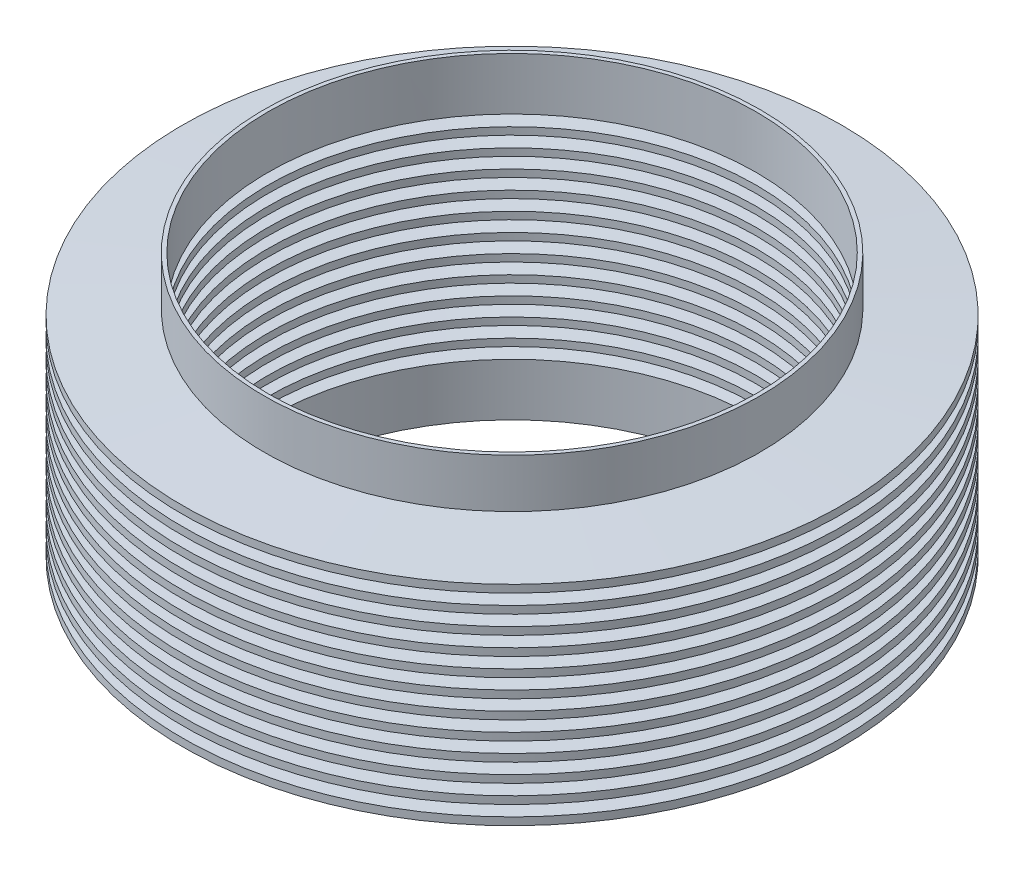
ISO-10303-21;
HEADER;
FILE_DESCRIPTION(('STEP AP214'),'2;1');
FILE_NAME('part.step','',(''),(''),'','','');
FILE_SCHEMA(('AUTOMOTIVE_DESIGN { 1 0 10303 214 1 1 1 1 }'));
ENDSEC;
DATA;
#1=APPLICATION_CONTEXT('core data for automotive mechanical design processes');
#2=APPLICATION_PROTOCOL_DEFINITION('international standard','automotive_design',2000,#1);
#3=PRODUCT_CONTEXT('',#1,'mechanical');
#4=PRODUCT('Part','Part','',(#3));
#5=PRODUCT_RELATED_PRODUCT_CATEGORY('part','',(#4));
#6=PRODUCT_DEFINITION_FORMATION('','',#4);
#7=PRODUCT_DEFINITION_CONTEXT('part definition',#1,'design');
#8=PRODUCT_DEFINITION('design','',#6,#7);
#9=PRODUCT_DEFINITION_SHAPE('','',#8);
#10=(LENGTH_UNIT() NAMED_UNIT(*) SI_UNIT(.MILLI.,.METRE.));
#11=(NAMED_UNIT(*) PLANE_ANGLE_UNIT() SI_UNIT($,.RADIAN.));
#12=(NAMED_UNIT(*) SI_UNIT($,.STERADIAN.) SOLID_ANGLE_UNIT());
#13=UNCERTAINTY_MEASURE_WITH_UNIT(LENGTH_MEASURE(1.E-05),#10,'distance_accuracy_value','');
#14=(GEOMETRIC_REPRESENTATION_CONTEXT(3) GLOBAL_UNCERTAINTY_ASSIGNED_CONTEXT((#13)) GLOBAL_UNIT_ASSIGNED_CONTEXT((#10,
#11,#12)) REPRESENTATION_CONTEXT('',''));
#15=CARTESIAN_POINT('',(0.,0.,0.));
#16=DIRECTION('',(0.,0.,1.));
#17=DIRECTION('',(1.,0.,0.));
#18=AXIS2_PLACEMENT_3D('',#15,#16,#17);
#19=CARTESIAN_POINT('',(0.,0.,0.));
#20=DIRECTION('',(0.,-1.,0.));
#21=DIRECTION('',(0.,0.,-1.));
#22=AXIS2_PLACEMENT_3D('',#19,#20,#21);
#23=CYLINDRICAL_SURFACE('',#22,63.5);
#24=CARTESIAN_POINT('',(0.,26.3515648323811,0.));
#25=DIRECTION('',(0.,-1.,0.));
#26=DIRECTION('',(0.,0.,-1.));
#27=AXIS2_PLACEMENT_3D('',#24,#25,#26);
#28=CIRCLE('',#27,63.5);
#29=CARTESIAN_POINT('',(0.,26.3515648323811,-63.5));
#30=VERTEX_POINT('',#29);
#31=EDGE_CURVE('E104',#30,#30,#28,.T.);
#32=ORIENTED_EDGE('',*,*,#31,.F.);
#33=EDGE_LOOP('',(#32));
#34=FACE_BOUND('',#33,.T.);
#35=CARTESIAN_POINT('',(0.,12.7,0.));
#36=DIRECTION('',(0.,-1.,0.));
#37=DIRECTION('',(0.,0.,-1.));
#38=AXIS2_PLACEMENT_3D('',#35,#36,#37);
#39=CIRCLE('',#38,63.5);
#40=CARTESIAN_POINT('',(0.,12.7,-63.5));
#41=VERTEX_POINT('',#40);
#42=EDGE_CURVE('E260',#41,#41,#39,.F.);
#43=ORIENTED_EDGE('',*,*,#42,.F.);
#44=EDGE_LOOP('',(#43));
#45=FACE_BOUND('',#44,.T.);
#46=ADVANCED_FACE('F30',(#34,#45),#23,.F.);
#47=CARTESIAN_POINT('',(0.,0.,0.));
#48=DIRECTION('',(0.,-1.,0.));
#49=DIRECTION('',(0.,0.,-1.));
#50=AXIS2_PLACEMENT_3D('',#47,#48,#49);
#51=CYLINDRICAL_SURFACE('',#50,64.516);
#52=CARTESIAN_POINT('',(0.,25.4,0.));
#53=DIRECTION('',(0.,-1.,0.));
#54=DIRECTION('',(0.,0.,-1.));
#55=AXIS2_PLACEMENT_3D('',#52,#53,#54);
#56=CIRCLE('',#55,64.516);
#57=CARTESIAN_POINT('',(0.,25.4,-64.516));
#58=VERTEX_POINT('',#57);
#59=EDGE_CURVE('E107',#58,#58,#56,.T.);
#60=ORIENTED_EDGE('',*,*,#59,.T.);
#61=EDGE_LOOP('',(#60));
#62=FACE_BOUND('',#61,.T.);
#63=CARTESIAN_POINT('',(0.,12.7,0.));
#64=DIRECTION('',(0.,-1.,0.));
#65=DIRECTION('',(0.,0.,-1.));
#66=AXIS2_PLACEMENT_3D('',#63,#64,#65);
#67=CIRCLE('',#66,64.516);
#68=CARTESIAN_POINT('',(0.,12.7,-64.516));
#69=VERTEX_POINT('',#68);
#70=EDGE_CURVE('E263',#69,#69,#67,.T.);
#71=ORIENTED_EDGE('',*,*,#70,.F.);
#72=EDGE_LOOP('',(#71));
#73=FACE_BOUND('',#72,.T.);
#74=ADVANCED_FACE('F270',(#62,#73),#51,.T.);
#75=CARTESIAN_POINT('',(0.,0.,0.));
#76=DIRECTION('',(0.,-1.,0.));
#77=DIRECTION('',(0.,0.,-1.));
#78=AXIS2_PLACEMENT_3D('',#75,#76,#77);
#79=CYLINDRICAL_SURFACE('',#78,64.516);
#80=CARTESIAN_POINT('',(0.,82.55,0.));
#81=DIRECTION('',(0.,-1.,0.));
#82=DIRECTION('',(0.,0.,-1.));
#83=AXIS2_PLACEMENT_3D('',#80,#81,#82);
#84=CIRCLE('',#83,64.516);
#85=CARTESIAN_POINT('',(0.,82.55,-64.516));
#86=VERTEX_POINT('',#85);
#87=EDGE_CURVE('E215',#86,#86,#84,.T.);
#88=ORIENTED_EDGE('',*,*,#87,.F.);
#89=EDGE_LOOP('',(#88));
#90=FACE_BOUND('',#89,.T.);
#91=CARTESIAN_POINT('',(0.,95.25,0.));
#92=DIRECTION('',(0.,-1.,0.));
#93=DIRECTION('',(0.,0.,-1.));
#94=AXIS2_PLACEMENT_3D('',#91,#92,#93);
#95=CIRCLE('',#94,64.516);
#96=CARTESIAN_POINT('',(0.,95.25,-64.516));
#97=VERTEX_POINT('',#96);
#98=EDGE_CURVE('E257',#97,#97,#95,.T.);
#99=ORIENTED_EDGE('',*,*,#98,.T.);
#100=EDGE_LOOP('',(#99));
#101=FACE_BOUND('',#100,.T.);
#102=ADVANCED_FACE('F272',(#90,#101),#79,.T.);
#103=CARTESIAN_POINT('',(0.,0.,0.));
#104=DIRECTION('',(0.,-1.,0.));
#105=DIRECTION('',(0.,0.,-1.));
#106=AXIS2_PLACEMENT_3D('',#103,#104,#105);
#107=CYLINDRICAL_SURFACE('',#106,63.5);
#108=CARTESIAN_POINT('',(0.,81.5984351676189,0.));
#109=DIRECTION('',(0.,-1.,0.));
#110=DIRECTION('',(0.,0.,-1.));
#111=AXIS2_PLACEMENT_3D('',#108,#109,#110);
#112=CIRCLE('',#111,63.5);
#113=CARTESIAN_POINT('',(0.,81.5984351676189,-63.5));
#114=VERTEX_POINT('',#113);
#115=EDGE_CURVE('E218',#114,#114,#112,.T.);
#116=ORIENTED_EDGE('',*,*,#115,.T.);
#117=EDGE_LOOP('',(#116));
#118=FACE_BOUND('',#117,.T.);
#119=CARTESIAN_POINT('',(0.,95.25,0.));
#120=DIRECTION('',(0.,1.,0.));
#121=DIRECTION('',(0.,0.,1.));
#122=AXIS2_PLACEMENT_3D('',#119,#120,#121);
#123=CIRCLE('',#122,63.5);
#124=CARTESIAN_POINT('',(0.,95.25,63.5));
#125=VERTEX_POINT('',#124);
#126=EDGE_CURVE('E34',#125,#125,#123,.F.);
#127=ORIENTED_EDGE('',*,*,#126,.F.);
#128=EDGE_LOOP('',(#127));
#129=FACE_BOUND('',#128,.T.);
#130=ADVANCED_FACE('F279',(#118,#129),#107,.F.);
#131=CARTESIAN_POINT('',(0.,61.11875,0.));
#132=DIRECTION('',(0.,-1.,0.));
#133=DIRECTION('',(0.,0.,-1.));
#134=AXIS2_PLACEMENT_3D('',#131,#132,#133);
#135=CONICAL_SURFACE('',#134,85.3047184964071,1.50532234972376);
#136=CARTESIAN_POINT('',(0.,62.5484351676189,0.));
#137=DIRECTION('',(0.,-1.,0.));
#138=DIRECTION('',(0.,0.,-1.));
#139=AXIS2_PLACEMENT_3D('',#136,#137,#138);
#140=CIRCLE('',#139,63.5);
#141=CARTESIAN_POINT('',(0.,62.5484351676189,-63.5));
#142=VERTEX_POINT('',#141);
#143=EDGE_CURVE('E254',#142,#142,#140,.T.);
#144=ORIENTED_EDGE('',*,*,#143,.F.);
#145=EDGE_LOOP('',(#144));
#146=FACE_BOUND('',#145,.T.);
#147=CARTESIAN_POINT('',(0.,61.11875,0.));
#148=DIRECTION('',(0.,-1.,0.));
#149=DIRECTION('',(0.,0.,-1.));
#150=AXIS2_PLACEMENT_3D('',#147,#148,#149);
#151=CIRCLE('',#150,85.3047184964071);
#152=CARTESIAN_POINT('',(0.,61.11875,-85.3047184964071));
#153=VERTEX_POINT('',#152);
#154=EDGE_CURVE('E10',#153,#153,#151,.T.);
#155=ORIENTED_EDGE('',*,*,#154,.T.);
#156=EDGE_LOOP('',(#155));
#157=FACE_BOUND('',#156,.T.);
#158=ADVANCED_FACE('F32',(#146,#157),#135,.F.);
#159=CARTESIAN_POINT('',(0.,59.6890648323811,0.));
#160=DIRECTION('',(0.,1.,0.));
#161=DIRECTION('',(0.,0.,1.));
#162=AXIS2_PLACEMENT_3D('',#159,#160,#161);
#163=CONICAL_SURFACE('',#162,63.5,1.50532234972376);
#164=ORIENTED_EDGE('',*,*,#154,.F.);
#165=EDGE_LOOP('',(#164));
#166=FACE_BOUND('',#165,.T.);
#167=CARTESIAN_POINT('',(0.,59.6890648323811,0.));
#168=DIRECTION('',(0.,-1.,0.));
#169=DIRECTION('',(0.,0.,-1.));
#170=AXIS2_PLACEMENT_3D('',#167,#168,#169);
#171=CIRCLE('',#170,63.5);
#172=CARTESIAN_POINT('',(0.,59.6890648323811,-63.5));
#173=VERTEX_POINT('',#172);
#174=EDGE_CURVE('E38',#173,#173,#171,.T.);
#175=ORIENTED_EDGE('',*,*,#174,.T.);
#176=EDGE_LOOP('',(#175));
#177=FACE_BOUND('',#176,.T.);
#178=ADVANCED_FACE('F370',(#166,#177),#163,.F.);
#179=CARTESIAN_POINT('',(0.,0.,0.));
#180=DIRECTION('',(0.,-1.,0.));
#181=DIRECTION('',(0.,0.,-1.));
#182=AXIS2_PLACEMENT_3D('',#179,#180,#181);
#183=CYLINDRICAL_SURFACE('',#182,63.5);
#184=ORIENTED_EDGE('',*,*,#174,.F.);
#185=EDGE_LOOP('',(#184));
#186=FACE_BOUND('',#185,.T.);
#187=CARTESIAN_POINT('',(0.,57.7859351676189,0.));
#188=DIRECTION('',(0.,-1.,0.));
#189=DIRECTION('',(0.,0.,-1.));
#190=AXIS2_PLACEMENT_3D('',#187,#188,#189);
#191=CIRCLE('',#190,63.5);
#192=CARTESIAN_POINT('',(0.,57.7859351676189,-63.5));
#193=VERTEX_POINT('',#192);
#194=EDGE_CURVE('E42',#193,#193,#191,.T.);
#195=ORIENTED_EDGE('',*,*,#194,.T.);
#196=EDGE_LOOP('',(#195));
#197=FACE_BOUND('',#196,.T.);
#198=ADVANCED_FACE('F367',(#186,#197),#183,.F.);
#199=CARTESIAN_POINT('',(0.,56.35625,0.));
#200=DIRECTION('',(0.,-1.,0.));
#201=DIRECTION('',(0.,0.,-1.));
#202=AXIS2_PLACEMENT_3D('',#199,#200,#201);
#203=CONICAL_SURFACE('',#202,85.3047184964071,1.50532234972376);
#204=ORIENTED_EDGE('',*,*,#194,.F.);
#205=EDGE_LOOP('',(#204));
#206=FACE_BOUND('',#205,.T.);
#207=CARTESIAN_POINT('',(0.,56.35625,0.));
#208=DIRECTION('',(0.,-1.,0.));
#209=DIRECTION('',(0.,0.,-1.));
#210=AXIS2_PLACEMENT_3D('',#207,#208,#209);
#211=CIRCLE('',#210,85.3047184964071);
#212=CARTESIAN_POINT('',(0.,56.35625,-85.3047184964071));
#213=VERTEX_POINT('',#212);
#214=EDGE_CURVE('E47',#213,#213,#211,.T.);
#215=ORIENTED_EDGE('',*,*,#214,.T.);
#216=EDGE_LOOP('',(#215));
#217=FACE_BOUND('',#216,.T.);
#218=ADVANCED_FACE('F363',(#206,#217),#203,.F.);
#219=CARTESIAN_POINT('',(0.,54.9265648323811,0.));
#220=DIRECTION('',(0.,1.,0.));
#221=DIRECTION('',(0.,0.,1.));
#222=AXIS2_PLACEMENT_3D('',#219,#220,#221);
#223=CONICAL_SURFACE('',#222,63.5,1.50532234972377);
#224=ORIENTED_EDGE('',*,*,#214,.F.);
#225=EDGE_LOOP('',(#224));
#226=FACE_BOUND('',#225,.T.);
#227=CARTESIAN_POINT('',(0.,54.9265648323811,0.));
#228=DIRECTION('',(0.,-1.,0.));
#229=DIRECTION('',(0.,0.,-1.));
#230=AXIS2_PLACEMENT_3D('',#227,#228,#229);
#231=CIRCLE('',#230,63.5);
#232=CARTESIAN_POINT('',(0.,54.9265648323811,-63.5));
#233=VERTEX_POINT('',#232);
#234=EDGE_CURVE('E50',#233,#233,#231,.T.);
#235=ORIENTED_EDGE('',*,*,#234,.T.);
#236=EDGE_LOOP('',(#235));
#237=FACE_BOUND('',#236,.T.);
#238=ADVANCED_FACE('F359',(#226,#237),#223,.F.);
#239=CARTESIAN_POINT('',(0.,0.,0.));
#240=DIRECTION('',(0.,-1.,0.));
#241=DIRECTION('',(0.,0.,-1.));
#242=AXIS2_PLACEMENT_3D('',#239,#240,#241);
#243=CYLINDRICAL_SURFACE('',#242,63.5);
#244=ORIENTED_EDGE('',*,*,#234,.F.);
#245=EDGE_LOOP('',(#244));
#246=FACE_BOUND('',#245,.T.);
#247=CARTESIAN_POINT('',(0.,53.0234351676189,0.));
#248=DIRECTION('',(0.,-1.,0.));
#249=DIRECTION('',(0.,0.,-1.));
#250=AXIS2_PLACEMENT_3D('',#247,#248,#249);
#251=CIRCLE('',#250,63.5);
#252=CARTESIAN_POINT('',(0.,53.0234351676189,-63.5));
#253=VERTEX_POINT('',#252);
#254=EDGE_CURVE('E53',#253,#253,#251,.T.);
#255=ORIENTED_EDGE('',*,*,#254,.T.);
#256=EDGE_LOOP('',(#255));
#257=FACE_BOUND('',#256,.T.);
#258=ADVANCED_FACE('F355',(#246,#257),#243,.F.);
#259=CARTESIAN_POINT('',(0.,51.59375,0.));
#260=DIRECTION('',(0.,-1.,0.));
#261=DIRECTION('',(0.,0.,-1.));
#262=AXIS2_PLACEMENT_3D('',#259,#260,#261);
#263=CONICAL_SURFACE('',#262,85.3047184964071,1.50532234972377);
#264=ORIENTED_EDGE('',*,*,#254,.F.);
#265=EDGE_LOOP('',(#264));
#266=FACE_BOUND('',#265,.T.);
#267=CARTESIAN_POINT('',(0.,51.59375,0.));
#268=DIRECTION('',(0.,-1.,0.));
#269=DIRECTION('',(0.,0.,-1.));
#270=AXIS2_PLACEMENT_3D('',#267,#268,#269);
#271=CIRCLE('',#270,85.3047184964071);
#272=CARTESIAN_POINT('',(0.,51.59375,-85.3047184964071));
#273=VERTEX_POINT('',#272);
#274=EDGE_CURVE('E56',#273,#273,#271,.T.);
#275=ORIENTED_EDGE('',*,*,#274,.T.);
#276=EDGE_LOOP('',(#275));
#277=FACE_BOUND('',#276,.T.);
#278=ADVANCED_FACE('F351',(#266,#277),#263,.F.);
#279=CARTESIAN_POINT('',(0.,50.1640648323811,0.));
#280=DIRECTION('',(0.,1.,0.));
#281=DIRECTION('',(0.,0.,1.));
#282=AXIS2_PLACEMENT_3D('',#279,#280,#281);
#283=CONICAL_SURFACE('',#282,63.5,1.50532234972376);
#284=ORIENTED_EDGE('',*,*,#274,.F.);
#285=EDGE_LOOP('',(#284));
#286=FACE_BOUND('',#285,.T.);
#287=CARTESIAN_POINT('',(0.,50.1640648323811,0.));
#288=DIRECTION('',(0.,-1.,0.));
#289=DIRECTION('',(0.,0.,-1.));
#290=AXIS2_PLACEMENT_3D('',#287,#288,#289);
#291=CIRCLE('',#290,63.5);
#292=CARTESIAN_POINT('',(0.,50.1640648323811,-63.5));
#293=VERTEX_POINT('',#292);
#294=EDGE_CURVE('E59',#293,#293,#291,.T.);
#295=ORIENTED_EDGE('',*,*,#294,.T.);
#296=EDGE_LOOP('',(#295));
#297=FACE_BOUND('',#296,.T.);
#298=ADVANCED_FACE('F347',(#286,#297),#283,.F.);
#299=CARTESIAN_POINT('',(0.,0.,0.));
#300=DIRECTION('',(0.,-1.,0.));
#301=DIRECTION('',(0.,0.,-1.));
#302=AXIS2_PLACEMENT_3D('',#299,#300,#301);
#303=CYLINDRICAL_SURFACE('',#302,63.5);
#304=ORIENTED_EDGE('',*,*,#294,.F.);
#305=EDGE_LOOP('',(#304));
#306=FACE_BOUND('',#305,.T.);
#307=CARTESIAN_POINT('',(0.,48.2609351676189,0.));
#308=DIRECTION('',(0.,-1.,0.));
#309=DIRECTION('',(0.,0.,-1.));
#310=AXIS2_PLACEMENT_3D('',#307,#308,#309);
#311=CIRCLE('',#310,63.5);
#312=CARTESIAN_POINT('',(0.,48.2609351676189,-63.5));
#313=VERTEX_POINT('',#312);
#314=EDGE_CURVE('E62',#313,#313,#311,.T.);
#315=ORIENTED_EDGE('',*,*,#314,.T.);
#316=EDGE_LOOP('',(#315));
#317=FACE_BOUND('',#316,.T.);
#318=ADVANCED_FACE('F343',(#306,#317),#303,.F.);
#319=CARTESIAN_POINT('',(0.,46.83125,0.));
#320=DIRECTION('',(0.,-1.,0.));
#321=DIRECTION('',(0.,0.,-1.));
#322=AXIS2_PLACEMENT_3D('',#319,#320,#321);
#323=CONICAL_SURFACE('',#322,85.3047184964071,1.50532234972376);
#324=ORIENTED_EDGE('',*,*,#314,.F.);
#325=EDGE_LOOP('',(#324));
#326=FACE_BOUND('',#325,.T.);
#327=CARTESIAN_POINT('',(0.,46.83125,0.));
#328=DIRECTION('',(0.,-1.,0.));
#329=DIRECTION('',(0.,0.,-1.));
#330=AXIS2_PLACEMENT_3D('',#327,#328,#329);
#331=CIRCLE('',#330,85.3047184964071);
#332=CARTESIAN_POINT('',(0.,46.83125,-85.3047184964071));
#333=VERTEX_POINT('',#332);
#334=EDGE_CURVE('E65',#333,#333,#331,.T.);
#335=ORIENTED_EDGE('',*,*,#334,.T.);
#336=EDGE_LOOP('',(#335));
#337=FACE_BOUND('',#336,.T.);
#338=ADVANCED_FACE('F339',(#326,#337),#323,.F.);
#339=CARTESIAN_POINT('',(0.,45.4015648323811,0.));
#340=DIRECTION('',(0.,1.,0.));
#341=DIRECTION('',(0.,0.,1.));
#342=AXIS2_PLACEMENT_3D('',#339,#340,#341);
#343=CONICAL_SURFACE('',#342,63.5,1.50532234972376);
#344=ORIENTED_EDGE('',*,*,#334,.F.);
#345=EDGE_LOOP('',(#344));
#346=FACE_BOUND('',#345,.T.);
#347=CARTESIAN_POINT('',(0.,45.4015648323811,0.));
#348=DIRECTION('',(0.,-1.,0.));
#349=DIRECTION('',(0.,0.,-1.));
#350=AXIS2_PLACEMENT_3D('',#347,#348,#349);
#351=CIRCLE('',#350,63.5);
#352=CARTESIAN_POINT('',(0.,45.4015648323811,-63.5));
#353=VERTEX_POINT('',#352);
#354=EDGE_CURVE('E68',#353,#353,#351,.T.);
#355=ORIENTED_EDGE('',*,*,#354,.T.);
#356=EDGE_LOOP('',(#355));
#357=FACE_BOUND('',#356,.T.);
#358=ADVANCED_FACE('F335',(#346,#357),#343,.F.);
#359=CARTESIAN_POINT('',(0.,0.,0.));
#360=DIRECTION('',(0.,-1.,0.));
#361=DIRECTION('',(0.,0.,-1.));
#362=AXIS2_PLACEMENT_3D('',#359,#360,#361);
#363=CYLINDRICAL_SURFACE('',#362,63.5);
#364=ORIENTED_EDGE('',*,*,#354,.F.);
#365=EDGE_LOOP('',(#364));
#366=FACE_BOUND('',#365,.T.);
#367=CARTESIAN_POINT('',(0.,43.498435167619,0.));
#368=DIRECTION('',(0.,-1.,0.));
#369=DIRECTION('',(0.,0.,-1.));
#370=AXIS2_PLACEMENT_3D('',#367,#368,#369);
#371=CIRCLE('',#370,63.5);
#372=CARTESIAN_POINT('',(0.,43.498435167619,-63.5));
#373=VERTEX_POINT('',#372);
#374=EDGE_CURVE('E71',#373,#373,#371,.T.);
#375=ORIENTED_EDGE('',*,*,#374,.T.);
#376=EDGE_LOOP('',(#375));
#377=FACE_BOUND('',#376,.T.);
#378=ADVANCED_FACE('F331',(#366,#377),#363,.F.);
#379=CARTESIAN_POINT('',(0.,42.06875,0.));
#380=DIRECTION('',(0.,-1.,0.));
#381=DIRECTION('',(0.,0.,-1.));
#382=AXIS2_PLACEMENT_3D('',#379,#380,#381);
#383=CONICAL_SURFACE('',#382,85.3047184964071,1.50532234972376);
#384=ORIENTED_EDGE('',*,*,#374,.F.);
#385=EDGE_LOOP('',(#384));
#386=FACE_BOUND('',#385,.T.);
#387=CARTESIAN_POINT('',(0.,42.06875,0.));
#388=DIRECTION('',(0.,-1.,0.));
#389=DIRECTION('',(0.,0.,-1.));
#390=AXIS2_PLACEMENT_3D('',#387,#388,#389);
#391=CIRCLE('',#390,85.3047184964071);
#392=CARTESIAN_POINT('',(0.,42.06875,-85.3047184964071));
#393=VERTEX_POINT('',#392);
#394=EDGE_CURVE('E74',#393,#393,#391,.T.);
#395=ORIENTED_EDGE('',*,*,#394,.T.);
#396=EDGE_LOOP('',(#395));
#397=FACE_BOUND('',#396,.T.);
#398=ADVANCED_FACE('F327',(#386,#397),#383,.F.);
#399=CARTESIAN_POINT('',(0.,40.6390648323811,0.));
#400=DIRECTION('',(0.,1.,0.));
#401=DIRECTION('',(0.,0.,1.));
#402=AXIS2_PLACEMENT_3D('',#399,#400,#401);
#403=CONICAL_SURFACE('',#402,63.5,1.50532234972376);
#404=ORIENTED_EDGE('',*,*,#394,.F.);
#405=EDGE_LOOP('',(#404));
#406=FACE_BOUND('',#405,.T.);
#407=CARTESIAN_POINT('',(0.,40.6390648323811,0.));
#408=DIRECTION('',(0.,-1.,0.));
#409=DIRECTION('',(0.,0.,-1.));
#410=AXIS2_PLACEMENT_3D('',#407,#408,#409);
#411=CIRCLE('',#410,63.5);
#412=CARTESIAN_POINT('',(0.,40.6390648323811,-63.5));
#413=VERTEX_POINT('',#412);
#414=EDGE_CURVE('E77',#413,#413,#411,.T.);
#415=ORIENTED_EDGE('',*,*,#414,.T.);
#416=EDGE_LOOP('',(#415));
#417=FACE_BOUND('',#416,.T.);
#418=ADVANCED_FACE('F323',(#406,#417),#403,.F.);
#419=CARTESIAN_POINT('',(0.,0.,0.));
#420=DIRECTION('',(0.,-1.,0.));
#421=DIRECTION('',(0.,0.,-1.));
#422=AXIS2_PLACEMENT_3D('',#419,#420,#421);
#423=CYLINDRICAL_SURFACE('',#422,63.5);
#424=ORIENTED_EDGE('',*,*,#414,.F.);
#425=EDGE_LOOP('',(#424));
#426=FACE_BOUND('',#425,.T.);
#427=CARTESIAN_POINT('',(0.,38.7359351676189,0.));
#428=DIRECTION('',(0.,-1.,0.));
#429=DIRECTION('',(0.,0.,-1.));
#430=AXIS2_PLACEMENT_3D('',#427,#428,#429);
#431=CIRCLE('',#430,63.5);
#432=CARTESIAN_POINT('',(0.,38.7359351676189,-63.5));
#433=VERTEX_POINT('',#432);
#434=EDGE_CURVE('E80',#433,#433,#431,.T.);
#435=ORIENTED_EDGE('',*,*,#434,.T.);
#436=EDGE_LOOP('',(#435));
#437=FACE_BOUND('',#436,.T.);
#438=ADVANCED_FACE('F319',(#426,#437),#423,.F.);
#439=CARTESIAN_POINT('',(0.,37.30625,0.));
#440=DIRECTION('',(0.,-1.,0.));
#441=DIRECTION('',(0.,0.,-1.));
#442=AXIS2_PLACEMENT_3D('',#439,#440,#441);
#443=CONICAL_SURFACE('',#442,85.3047184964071,1.50532234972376);
#444=ORIENTED_EDGE('',*,*,#434,.F.);
#445=EDGE_LOOP('',(#444));
#446=FACE_BOUND('',#445,.T.);
#447=CARTESIAN_POINT('',(0.,37.30625,0.));
#448=DIRECTION('',(0.,-1.,0.));
#449=DIRECTION('',(0.,0.,-1.));
#450=AXIS2_PLACEMENT_3D('',#447,#448,#449);
#451=CIRCLE('',#450,85.3047184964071);
#452=CARTESIAN_POINT('',(0.,37.30625,-85.3047184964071));
#453=VERTEX_POINT('',#452);
#454=EDGE_CURVE('E83',#453,#453,#451,.T.);
#455=ORIENTED_EDGE('',*,*,#454,.T.);
#456=EDGE_LOOP('',(#455));
#457=FACE_BOUND('',#456,.T.);
#458=ADVANCED_FACE('F315',(#446,#457),#443,.F.);
#459=CARTESIAN_POINT('',(0.,35.8765648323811,0.));
#460=DIRECTION('',(0.,1.,0.));
#461=DIRECTION('',(0.,0.,1.));
#462=AXIS2_PLACEMENT_3D('',#459,#460,#461);
#463=CONICAL_SURFACE('',#462,63.5,1.50532234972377);
#464=ORIENTED_EDGE('',*,*,#454,.F.);
#465=EDGE_LOOP('',(#464));
#466=FACE_BOUND('',#465,.T.);
#467=CARTESIAN_POINT('',(0.,35.8765648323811,0.));
#468=DIRECTION('',(0.,-1.,0.));
#469=DIRECTION('',(0.,0.,-1.));
#470=AXIS2_PLACEMENT_3D('',#467,#468,#469);
#471=CIRCLE('',#470,63.5);
#472=CARTESIAN_POINT('',(0.,35.8765648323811,-63.5));
#473=VERTEX_POINT('',#472);
#474=EDGE_CURVE('E86',#473,#473,#471,.T.);
#475=ORIENTED_EDGE('',*,*,#474,.T.);
#476=EDGE_LOOP('',(#475));
#477=FACE_BOUND('',#476,.T.);
#478=ADVANCED_FACE('F311',(#466,#477),#463,.F.);
#479=CARTESIAN_POINT('',(0.,0.,0.));
#480=DIRECTION('',(0.,-1.,0.));
#481=DIRECTION('',(0.,0.,-1.));
#482=AXIS2_PLACEMENT_3D('',#479,#480,#481);
#483=CYLINDRICAL_SURFACE('',#482,63.5);
#484=ORIENTED_EDGE('',*,*,#474,.F.);
#485=EDGE_LOOP('',(#484));
#486=FACE_BOUND('',#485,.T.);
#487=CARTESIAN_POINT('',(0.,33.9734351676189,0.));
#488=DIRECTION('',(0.,-1.,0.));
#489=DIRECTION('',(0.,0.,-1.));
#490=AXIS2_PLACEMENT_3D('',#487,#488,#489);
#491=CIRCLE('',#490,63.5);
#492=CARTESIAN_POINT('',(0.,33.9734351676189,-63.5));
#493=VERTEX_POINT('',#492);
#494=EDGE_CURVE('E89',#493,#493,#491,.T.);
#495=ORIENTED_EDGE('',*,*,#494,.T.);
#496=EDGE_LOOP('',(#495));
#497=FACE_BOUND('',#496,.T.);
#498=ADVANCED_FACE('F307',(#486,#497),#483,.F.);
#499=CARTESIAN_POINT('',(0.,32.54375,0.));
#500=DIRECTION('',(0.,-1.,0.));
#501=DIRECTION('',(0.,0.,-1.));
#502=AXIS2_PLACEMENT_3D('',#499,#500,#501);
#503=CONICAL_SURFACE('',#502,85.3047184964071,1.50532234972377);
#504=ORIENTED_EDGE('',*,*,#494,.F.);
#505=EDGE_LOOP('',(#504));
#506=FACE_BOUND('',#505,.T.);
#507=CARTESIAN_POINT('',(0.,32.54375,0.));
#508=DIRECTION('',(0.,-1.,0.));
#509=DIRECTION('',(0.,0.,-1.));
#510=AXIS2_PLACEMENT_3D('',#507,#508,#509);
#511=CIRCLE('',#510,85.3047184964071);
#512=CARTESIAN_POINT('',(0.,32.54375,-85.3047184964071));
#513=VERTEX_POINT('',#512);
#514=EDGE_CURVE('E92',#513,#513,#511,.T.);
#515=ORIENTED_EDGE('',*,*,#514,.T.);
#516=EDGE_LOOP('',(#515));
#517=FACE_BOUND('',#516,.T.);
#518=ADVANCED_FACE('F303',(#506,#517),#503,.F.);
#519=CARTESIAN_POINT('',(0.,31.1140648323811,0.));
#520=DIRECTION('',(0.,1.,0.));
#521=DIRECTION('',(0.,0.,1.));
#522=AXIS2_PLACEMENT_3D('',#519,#520,#521);
#523=CONICAL_SURFACE('',#522,63.5,1.50532234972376);
#524=ORIENTED_EDGE('',*,*,#514,.F.);
#525=EDGE_LOOP('',(#524));
#526=FACE_BOUND('',#525,.T.);
#527=CARTESIAN_POINT('',(0.,31.1140648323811,0.));
#528=DIRECTION('',(0.,-1.,0.));
#529=DIRECTION('',(0.,0.,-1.));
#530=AXIS2_PLACEMENT_3D('',#527,#528,#529);
#531=CIRCLE('',#530,63.5);
#532=CARTESIAN_POINT('',(0.,31.1140648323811,-63.5));
#533=VERTEX_POINT('',#532);
#534=EDGE_CURVE('E95',#533,#533,#531,.T.);
#535=ORIENTED_EDGE('',*,*,#534,.T.);
#536=EDGE_LOOP('',(#535));
#537=FACE_BOUND('',#536,.T.);
#538=ADVANCED_FACE('F299',(#526,#537),#523,.F.);
#539=CARTESIAN_POINT('',(0.,0.,0.));
#540=DIRECTION('',(0.,-1.,0.));
#541=DIRECTION('',(0.,0.,-1.));
#542=AXIS2_PLACEMENT_3D('',#539,#540,#541);
#543=CYLINDRICAL_SURFACE('',#542,63.5);
#544=ORIENTED_EDGE('',*,*,#534,.F.);
#545=EDGE_LOOP('',(#544));
#546=FACE_BOUND('',#545,.T.);
#547=CARTESIAN_POINT('',(0.,29.2109351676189,0.));
#548=DIRECTION('',(0.,-1.,0.));
#549=DIRECTION('',(0.,0.,-1.));
#550=AXIS2_PLACEMENT_3D('',#547,#548,#549);
#551=CIRCLE('',#550,63.5);
#552=CARTESIAN_POINT('',(0.,29.2109351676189,-63.5));
#553=VERTEX_POINT('',#552);
#554=EDGE_CURVE('E98',#553,#553,#551,.T.);
#555=ORIENTED_EDGE('',*,*,#554,.T.);
#556=EDGE_LOOP('',(#555));
#557=FACE_BOUND('',#556,.T.);
#558=ADVANCED_FACE('F295',(#546,#557),#543,.F.);
#559=CARTESIAN_POINT('',(0.,27.78125,0.));
#560=DIRECTION('',(0.,-1.,0.));
#561=DIRECTION('',(0.,0.,-1.));
#562=AXIS2_PLACEMENT_3D('',#559,#560,#561);
#563=CONICAL_SURFACE('',#562,85.3047184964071,1.50532234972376);
#564=ORIENTED_EDGE('',*,*,#554,.F.);
#565=EDGE_LOOP('',(#564));
#566=FACE_BOUND('',#565,.T.);
#567=CARTESIAN_POINT('',(0.,27.78125,0.));
#568=DIRECTION('',(0.,-1.,0.));
#569=DIRECTION('',(0.,0.,-1.));
#570=AXIS2_PLACEMENT_3D('',#567,#568,#569);
#571=CIRCLE('',#570,85.3047184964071);
#572=CARTESIAN_POINT('',(0.,27.78125,-85.3047184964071));
#573=VERTEX_POINT('',#572);
#574=EDGE_CURVE('E101',#573,#573,#571,.T.);
#575=ORIENTED_EDGE('',*,*,#574,.T.);
#576=EDGE_LOOP('',(#575));
#577=FACE_BOUND('',#576,.T.);
#578=ADVANCED_FACE('F291',(#566,#577),#563,.F.);
#579=CARTESIAN_POINT('',(0.,26.3515648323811,0.));
#580=DIRECTION('',(0.,1.,0.));
#581=DIRECTION('',(0.,0.,1.));
#582=AXIS2_PLACEMENT_3D('',#579,#580,#581);
#583=CONICAL_SURFACE('',#582,63.5,1.50532234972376);
#584=ORIENTED_EDGE('',*,*,#574,.F.);
#585=EDGE_LOOP('',(#584));
#586=FACE_BOUND('',#585,.T.);
#587=ORIENTED_EDGE('',*,*,#31,.T.);
#588=EDGE_LOOP('',(#587));
#589=FACE_BOUND('',#588,.T.);
#590=ADVANCED_FACE('F288',(#586,#589),#583,.F.);
#591=CARTESIAN_POINT('',(0.,26.7906252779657,0.));
#592=DIRECTION('',(0.,1.,0.));
#593=DIRECTION('',(0.,0.,1.));
#594=AXIS2_PLACEMENT_3D('',#591,#592,#593);
#595=CONICAL_SURFACE('',#594,85.725,1.50532234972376);
#596=ORIENTED_EDGE('',*,*,#59,.F.);
#597=EDGE_LOOP('',(#596));
#598=FACE_BOUND('',#597,.T.);
#599=CARTESIAN_POINT('',(0.,26.7906252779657,0.));
#600=DIRECTION('',(0.,-1.,0.));
#601=DIRECTION('',(0.,0.,-1.));
#602=AXIS2_PLACEMENT_3D('',#599,#600,#601);
#603=CIRCLE('',#602,85.725);
#604=CARTESIAN_POINT('',(0.,26.7906252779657,-85.725));
#605=VERTEX_POINT('',#604);
#606=EDGE_CURVE('E110',#605,#605,#603,.T.);
#607=ORIENTED_EDGE('',*,*,#606,.T.);
#608=EDGE_LOOP('',(#607));
#609=FACE_BOUND('',#608,.T.);
#610=ADVANCED_FACE('F285',(#598,#609),#595,.T.);
#611=CARTESIAN_POINT('',(0.,0.,0.));
#612=DIRECTION('',(0.,-1.,0.));
#613=DIRECTION('',(0.,0.,-1.));
#614=AXIS2_PLACEMENT_3D('',#611,#612,#613);
#615=CYLINDRICAL_SURFACE('',#614,85.725);
#616=ORIENTED_EDGE('',*,*,#606,.F.);
#617=EDGE_LOOP('',(#616));
#618=FACE_BOUND('',#617,.T.);
#619=CARTESIAN_POINT('',(0.,28.7718747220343,0.));
#620=DIRECTION('',(0.,-1.,0.));
#621=DIRECTION('',(0.,0.,-1.));
#622=AXIS2_PLACEMENT_3D('',#619,#620,#621);
#623=CIRCLE('',#622,85.725);
#624=CARTESIAN_POINT('',(0.,28.7718747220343,-85.725));
#625=VERTEX_POINT('',#624);
#626=EDGE_CURVE('E113',#625,#625,#623,.T.);
#627=ORIENTED_EDGE('',*,*,#626,.T.);
#628=EDGE_LOOP('',(#627));
#629=FACE_BOUND('',#628,.T.);
#630=ADVANCED_FACE('F618',(#618,#629),#615,.T.);
#631=CARTESIAN_POINT('',(0.,30.1625,0.));
#632=DIRECTION('',(0.,-1.,0.));
#633=DIRECTION('',(0.,0.,-1.));
#634=AXIS2_PLACEMENT_3D('',#631,#632,#633);
#635=CONICAL_SURFACE('',#634,64.516,1.50532234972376);
#636=ORIENTED_EDGE('',*,*,#626,.F.);
#637=EDGE_LOOP('',(#636));
#638=FACE_BOUND('',#637,.T.);
#639=CARTESIAN_POINT('',(0.,30.1625,0.));
#640=DIRECTION('',(0.,-1.,0.));
#641=DIRECTION('',(0.,0.,-1.));
#642=AXIS2_PLACEMENT_3D('',#639,#640,#641);
#643=CIRCLE('',#642,64.516);
#644=CARTESIAN_POINT('',(0.,30.1625,-64.516));
#645=VERTEX_POINT('',#644);
#646=EDGE_CURVE('E116',#645,#645,#643,.T.);
#647=ORIENTED_EDGE('',*,*,#646,.T.);
#648=EDGE_LOOP('',(#647));
#649=FACE_BOUND('',#648,.T.);
#650=ADVANCED_FACE('F615',(#638,#649),#635,.T.);
#651=CARTESIAN_POINT('',(0.,31.5531252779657,0.));
#652=DIRECTION('',(0.,1.,0.));
#653=DIRECTION('',(0.,0.,1.));
#654=AXIS2_PLACEMENT_3D('',#651,#652,#653);
#655=CONICAL_SURFACE('',#654,85.725,1.50532234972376);
#656=ORIENTED_EDGE('',*,*,#646,.F.);
#657=EDGE_LOOP('',(#656));
#658=FACE_BOUND('',#657,.T.);
#659=CARTESIAN_POINT('',(0.,31.5531252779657,0.));
#660=DIRECTION('',(0.,-1.,0.));
#661=DIRECTION('',(0.,0.,-1.));
#662=AXIS2_PLACEMENT_3D('',#659,#660,#661);
#663=CIRCLE('',#662,85.725);
#664=CARTESIAN_POINT('',(0.,31.5531252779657,-85.725));
#665=VERTEX_POINT('',#664);
#666=EDGE_CURVE('E119',#665,#665,#663,.T.);
#667=ORIENTED_EDGE('',*,*,#666,.T.);
#668=EDGE_LOOP('',(#667));
#669=FACE_BOUND('',#668,.T.);
#670=ADVANCED_FACE('F611',(#658,#669),#655,.T.);
#671=CARTESIAN_POINT('',(0.,0.,0.));
#672=DIRECTION('',(0.,-1.,0.));
#673=DIRECTION('',(0.,0.,-1.));
#674=AXIS2_PLACEMENT_3D('',#671,#672,#673);
#675=CYLINDRICAL_SURFACE('',#674,85.725);
#676=ORIENTED_EDGE('',*,*,#666,.F.);
#677=EDGE_LOOP('',(#676));
#678=FACE_BOUND('',#677,.T.);
#679=CARTESIAN_POINT('',(0.,33.5343747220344,0.));
#680=DIRECTION('',(0.,-1.,0.));
#681=DIRECTION('',(0.,0.,-1.));
#682=AXIS2_PLACEMENT_3D('',#679,#680,#681);
#683=CIRCLE('',#682,85.725);
#684=CARTESIAN_POINT('',(0.,33.5343747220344,-85.725));
#685=VERTEX_POINT('',#684);
#686=EDGE_CURVE('E122',#685,#685,#683,.T.);
#687=ORIENTED_EDGE('',*,*,#686,.T.);
#688=EDGE_LOOP('',(#687));
#689=FACE_BOUND('',#688,.T.);
#690=ADVANCED_FACE('F607',(#678,#689),#675,.T.);
#691=CARTESIAN_POINT('',(0.,34.925,0.));
#692=DIRECTION('',(0.,-1.,0.));
#693=DIRECTION('',(0.,0.,-1.));
#694=AXIS2_PLACEMENT_3D('',#691,#692,#693);
#695=CONICAL_SURFACE('',#694,64.516,1.50532234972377);
#696=ORIENTED_EDGE('',*,*,#686,.F.);
#697=EDGE_LOOP('',(#696));
#698=FACE_BOUND('',#697,.T.);
#699=CARTESIAN_POINT('',(0.,34.925,0.));
#700=DIRECTION('',(0.,-1.,0.));
#701=DIRECTION('',(0.,0.,-1.));
#702=AXIS2_PLACEMENT_3D('',#699,#700,#701);
#703=CIRCLE('',#702,64.516);
#704=CARTESIAN_POINT('',(0.,34.925,-64.516));
#705=VERTEX_POINT('',#704);
#706=EDGE_CURVE('E125',#705,#705,#703,.T.);
#707=ORIENTED_EDGE('',*,*,#706,.T.);
#708=EDGE_LOOP('',(#707));
#709=FACE_BOUND('',#708,.T.);
#710=ADVANCED_FACE('F603',(#698,#709),#695,.T.);
#711=CARTESIAN_POINT('',(0.,36.3156252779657,0.));
#712=DIRECTION('',(0.,1.,0.));
#713=DIRECTION('',(0.,0.,1.));
#714=AXIS2_PLACEMENT_3D('',#711,#712,#713);
#715=CONICAL_SURFACE('',#714,85.725,1.50532234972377);
#716=ORIENTED_EDGE('',*,*,#706,.F.);
#717=EDGE_LOOP('',(#716));
#718=FACE_BOUND('',#717,.T.);
#719=CARTESIAN_POINT('',(0.,36.3156252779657,0.));
#720=DIRECTION('',(0.,-1.,0.));
#721=DIRECTION('',(0.,0.,-1.));
#722=AXIS2_PLACEMENT_3D('',#719,#720,#721);
#723=CIRCLE('',#722,85.725);
#724=CARTESIAN_POINT('',(0.,36.3156252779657,-85.725));
#725=VERTEX_POINT('',#724);
#726=EDGE_CURVE('E128',#725,#725,#723,.T.);
#727=ORIENTED_EDGE('',*,*,#726,.T.);
#728=EDGE_LOOP('',(#727));
#729=FACE_BOUND('',#728,.T.);
#730=ADVANCED_FACE('F599',(#718,#729),#715,.T.);
#731=CARTESIAN_POINT('',(0.,0.,0.));
#732=DIRECTION('',(0.,-1.,0.));
#733=DIRECTION('',(0.,0.,-1.));
#734=AXIS2_PLACEMENT_3D('',#731,#732,#733);
#735=CYLINDRICAL_SURFACE('',#734,85.725);
#736=ORIENTED_EDGE('',*,*,#726,.F.);
#737=EDGE_LOOP('',(#736));
#738=FACE_BOUND('',#737,.T.);
#739=CARTESIAN_POINT('',(0.,38.2968747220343,0.));
#740=DIRECTION('',(0.,-1.,0.));
#741=DIRECTION('',(0.,0.,-1.));
#742=AXIS2_PLACEMENT_3D('',#739,#740,#741);
#743=CIRCLE('',#742,85.725);
#744=CARTESIAN_POINT('',(0.,38.2968747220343,-85.725));
#745=VERTEX_POINT('',#744);
#746=EDGE_CURVE('E131',#745,#745,#743,.T.);
#747=ORIENTED_EDGE('',*,*,#746,.T.);
#748=EDGE_LOOP('',(#747));
#749=FACE_BOUND('',#748,.T.);
#750=ADVANCED_FACE('F595',(#738,#749),#735,.T.);
#751=CARTESIAN_POINT('',(0.,39.6875,0.));
#752=DIRECTION('',(0.,-1.,0.));
#753=DIRECTION('',(0.,0.,-1.));
#754=AXIS2_PLACEMENT_3D('',#751,#752,#753);
#755=CONICAL_SURFACE('',#754,64.516,1.50532234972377);
#756=ORIENTED_EDGE('',*,*,#746,.F.);
#757=EDGE_LOOP('',(#756));
#758=FACE_BOUND('',#757,.T.);
#759=CARTESIAN_POINT('',(0.,39.6875,0.));
#760=DIRECTION('',(0.,-1.,0.));
#761=DIRECTION('',(0.,0.,-1.));
#762=AXIS2_PLACEMENT_3D('',#759,#760,#761);
#763=CIRCLE('',#762,64.516);
#764=CARTESIAN_POINT('',(0.,39.6875,-64.516));
#765=VERTEX_POINT('',#764);
#766=EDGE_CURVE('E134',#765,#765,#763,.T.);
#767=ORIENTED_EDGE('',*,*,#766,.T.);
#768=EDGE_LOOP('',(#767));
#769=FACE_BOUND('',#768,.T.);
#770=ADVANCED_FACE('F591',(#758,#769),#755,.T.);
#771=CARTESIAN_POINT('',(0.,41.0781252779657,0.));
#772=DIRECTION('',(0.,1.,0.));
#773=DIRECTION('',(0.,0.,1.));
#774=AXIS2_PLACEMENT_3D('',#771,#772,#773);
#775=CONICAL_SURFACE('',#774,85.725,1.50532234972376);
#776=ORIENTED_EDGE('',*,*,#766,.F.);
#777=EDGE_LOOP('',(#776));
#778=FACE_BOUND('',#777,.T.);
#779=CARTESIAN_POINT('',(0.,41.0781252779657,0.));
#780=DIRECTION('',(0.,-1.,0.));
#781=DIRECTION('',(0.,0.,-1.));
#782=AXIS2_PLACEMENT_3D('',#779,#780,#781);
#783=CIRCLE('',#782,85.725);
#784=CARTESIAN_POINT('',(0.,41.0781252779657,-85.725));
#785=VERTEX_POINT('',#784);
#786=EDGE_CURVE('E137',#785,#785,#783,.T.);
#787=ORIENTED_EDGE('',*,*,#786,.T.);
#788=EDGE_LOOP('',(#787));
#789=FACE_BOUND('',#788,.T.);
#790=ADVANCED_FACE('F587',(#778,#789),#775,.T.);
#791=CARTESIAN_POINT('',(0.,0.,0.));
#792=DIRECTION('',(0.,-1.,0.));
#793=DIRECTION('',(0.,0.,-1.));
#794=AXIS2_PLACEMENT_3D('',#791,#792,#793);
#795=CYLINDRICAL_SURFACE('',#794,85.725);
#796=ORIENTED_EDGE('',*,*,#786,.F.);
#797=EDGE_LOOP('',(#796));
#798=FACE_BOUND('',#797,.T.);
#799=CARTESIAN_POINT('',(0.,43.0593747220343,0.));
#800=DIRECTION('',(0.,-1.,0.));
#801=DIRECTION('',(0.,0.,-1.));
#802=AXIS2_PLACEMENT_3D('',#799,#800,#801);
#803=CIRCLE('',#802,85.725);
#804=CARTESIAN_POINT('',(0.,43.0593747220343,-85.725));
#805=VERTEX_POINT('',#804);
#806=EDGE_CURVE('E140',#805,#805,#803,.T.);
#807=ORIENTED_EDGE('',*,*,#806,.T.);
#808=EDGE_LOOP('',(#807));
#809=FACE_BOUND('',#808,.T.);
#810=ADVANCED_FACE('F583',(#798,#809),#795,.T.);
#811=CARTESIAN_POINT('',(0.,44.45,0.));
#812=DIRECTION('',(0.,-1.,0.));
#813=DIRECTION('',(0.,0.,-1.));
#814=AXIS2_PLACEMENT_3D('',#811,#812,#813);
#815=CONICAL_SURFACE('',#814,64.516,1.50532234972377);
#816=ORIENTED_EDGE('',*,*,#806,.F.);
#817=EDGE_LOOP('',(#816));
#818=FACE_BOUND('',#817,.T.);
#819=CARTESIAN_POINT('',(0.,44.45,0.));
#820=DIRECTION('',(0.,-1.,0.));
#821=DIRECTION('',(0.,0.,-1.));
#822=AXIS2_PLACEMENT_3D('',#819,#820,#821);
#823=CIRCLE('',#822,64.516);
#824=CARTESIAN_POINT('',(0.,44.45,-64.516));
#825=VERTEX_POINT('',#824);
#826=EDGE_CURVE('E143',#825,#825,#823,.T.);
#827=ORIENTED_EDGE('',*,*,#826,.T.);
#828=EDGE_LOOP('',(#827));
#829=FACE_BOUND('',#828,.T.);
#830=ADVANCED_FACE('F579',(#818,#829),#815,.T.);
#831=CARTESIAN_POINT('',(0.,45.8406252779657,0.));
#832=DIRECTION('',(0.,1.,0.));
#833=DIRECTION('',(0.,0.,1.));
#834=AXIS2_PLACEMENT_3D('',#831,#832,#833);
#835=CONICAL_SURFACE('',#834,85.725,1.50532234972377);
#836=ORIENTED_EDGE('',*,*,#826,.F.);
#837=EDGE_LOOP('',(#836));
#838=FACE_BOUND('',#837,.T.);
#839=CARTESIAN_POINT('',(0.,45.8406252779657,0.));
#840=DIRECTION('',(0.,-1.,0.));
#841=DIRECTION('',(0.,0.,-1.));
#842=AXIS2_PLACEMENT_3D('',#839,#840,#841);
#843=CIRCLE('',#842,85.725);
#844=CARTESIAN_POINT('',(0.,45.8406252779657,-85.725));
#845=VERTEX_POINT('',#844);
#846=EDGE_CURVE('E146',#845,#845,#843,.T.);
#847=ORIENTED_EDGE('',*,*,#846,.T.);
#848=EDGE_LOOP('',(#847));
#849=FACE_BOUND('',#848,.T.);
#850=ADVANCED_FACE('F575',(#838,#849),#835,.T.);
#851=CARTESIAN_POINT('',(0.,0.,0.));
#852=DIRECTION('',(0.,-1.,0.));
#853=DIRECTION('',(0.,0.,-1.));
#854=AXIS2_PLACEMENT_3D('',#851,#852,#853);
#855=CYLINDRICAL_SURFACE('',#854,85.725);
#856=ORIENTED_EDGE('',*,*,#846,.F.);
#857=EDGE_LOOP('',(#856));
#858=FACE_BOUND('',#857,.T.);
#859=CARTESIAN_POINT('',(0.,47.8218747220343,0.));
#860=DIRECTION('',(0.,-1.,0.));
#861=DIRECTION('',(0.,0.,-1.));
#862=AXIS2_PLACEMENT_3D('',#859,#860,#861);
#863=CIRCLE('',#862,85.725);
#864=CARTESIAN_POINT('',(0.,47.8218747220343,-85.725));
#865=VERTEX_POINT('',#864);
#866=EDGE_CURVE('E149',#865,#865,#863,.T.);
#867=ORIENTED_EDGE('',*,*,#866,.T.);
#868=EDGE_LOOP('',(#867));
#869=FACE_BOUND('',#868,.T.);
#870=ADVANCED_FACE('F571',(#858,#869),#855,.T.);
#871=CARTESIAN_POINT('',(0.,49.2125,0.));
#872=DIRECTION('',(0.,-1.,0.));
#873=DIRECTION('',(0.,0.,-1.));
#874=AXIS2_PLACEMENT_3D('',#871,#872,#873);
#875=CONICAL_SURFACE('',#874,64.516,1.50532234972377);
#876=ORIENTED_EDGE('',*,*,#866,.F.);
#877=EDGE_LOOP('',(#876));
#878=FACE_BOUND('',#877,.T.);
#879=CARTESIAN_POINT('',(0.,49.2125,0.));
#880=DIRECTION('',(0.,-1.,0.));
#881=DIRECTION('',(0.,0.,-1.));
#882=AXIS2_PLACEMENT_3D('',#879,#880,#881);
#883=CIRCLE('',#882,64.516);
#884=CARTESIAN_POINT('',(0.,49.2125,-64.516));
#885=VERTEX_POINT('',#884);
#886=EDGE_CURVE('E152',#885,#885,#883,.T.);
#887=ORIENTED_EDGE('',*,*,#886,.T.);
#888=EDGE_LOOP('',(#887));
#889=FACE_BOUND('',#888,.T.);
#890=ADVANCED_FACE('F567',(#878,#889),#875,.T.);
#891=CARTESIAN_POINT('',(0.,50.6031252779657,0.));
#892=DIRECTION('',(0.,1.,0.));
#893=DIRECTION('',(0.,0.,1.));
#894=AXIS2_PLACEMENT_3D('',#891,#892,#893);
#895=CONICAL_SURFACE('',#894,85.725,1.50532234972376);
#896=ORIENTED_EDGE('',*,*,#886,.F.);
#897=EDGE_LOOP('',(#896));
#898=FACE_BOUND('',#897,.T.);
#899=CARTESIAN_POINT('',(0.,50.6031252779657,0.));
#900=DIRECTION('',(0.,-1.,0.));
#901=DIRECTION('',(0.,0.,-1.));
#902=AXIS2_PLACEMENT_3D('',#899,#900,#901);
#903=CIRCLE('',#902,85.725);
#904=CARTESIAN_POINT('',(0.,50.6031252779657,-85.725));
#905=VERTEX_POINT('',#904);
#906=EDGE_CURVE('E155',#905,#905,#903,.T.);
#907=ORIENTED_EDGE('',*,*,#906,.T.);
#908=EDGE_LOOP('',(#907));
#909=FACE_BOUND('',#908,.T.);
#910=ADVANCED_FACE('F563',(#898,#909),#895,.T.);
#911=CARTESIAN_POINT('',(0.,0.,0.));
#912=DIRECTION('',(0.,-1.,0.));
#913=DIRECTION('',(0.,0.,-1.));
#914=AXIS2_PLACEMENT_3D('',#911,#912,#913);
#915=CYLINDRICAL_SURFACE('',#914,85.725);
#916=ORIENTED_EDGE('',*,*,#906,.F.);
#917=EDGE_LOOP('',(#916));
#918=FACE_BOUND('',#917,.T.);
#919=CARTESIAN_POINT('',(0.,52.5843747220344,0.));
#920=DIRECTION('',(0.,-1.,0.));
#921=DIRECTION('',(0.,0.,-1.));
#922=AXIS2_PLACEMENT_3D('',#919,#920,#921);
#923=CIRCLE('',#922,85.725);
#924=CARTESIAN_POINT('',(0.,52.5843747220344,-85.725));
#925=VERTEX_POINT('',#924);
#926=EDGE_CURVE('E158',#925,#925,#923,.T.);
#927=ORIENTED_EDGE('',*,*,#926,.T.);
#928=EDGE_LOOP('',(#927));
#929=FACE_BOUND('',#928,.T.);
#930=ADVANCED_FACE('F559',(#918,#929),#915,.T.);
#931=CARTESIAN_POINT('',(0.,53.975,0.));
#932=DIRECTION('',(0.,-1.,0.));
#933=DIRECTION('',(0.,0.,-1.));
#934=AXIS2_PLACEMENT_3D('',#931,#932,#933);
#935=CONICAL_SURFACE('',#934,64.516,1.50532234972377);
#936=ORIENTED_EDGE('',*,*,#926,.F.);
#937=EDGE_LOOP('',(#936));
#938=FACE_BOUND('',#937,.T.);
#939=CARTESIAN_POINT('',(0.,53.975,0.));
#940=DIRECTION('',(0.,-1.,0.));
#941=DIRECTION('',(0.,0.,-1.));
#942=AXIS2_PLACEMENT_3D('',#939,#940,#941);
#943=CIRCLE('',#942,64.516);
#944=CARTESIAN_POINT('',(0.,53.975,-64.516));
#945=VERTEX_POINT('',#944);
#946=EDGE_CURVE('E161',#945,#945,#943,.T.);
#947=ORIENTED_EDGE('',*,*,#946,.T.);
#948=EDGE_LOOP('',(#947));
#949=FACE_BOUND('',#948,.T.);
#950=ADVANCED_FACE('F555',(#938,#949),#935,.T.);
#951=CARTESIAN_POINT('',(0.,55.3656252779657,0.));
#952=DIRECTION('',(0.,1.,0.));
#953=DIRECTION('',(0.,0.,1.));
#954=AXIS2_PLACEMENT_3D('',#951,#952,#953);
#955=CONICAL_SURFACE('',#954,85.725,1.50532234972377);
#956=ORIENTED_EDGE('',*,*,#946,.F.);
#957=EDGE_LOOP('',(#956));
#958=FACE_BOUND('',#957,.T.);
#959=CARTESIAN_POINT('',(0.,55.3656252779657,0.));
#960=DIRECTION('',(0.,-1.,0.));
#961=DIRECTION('',(0.,0.,-1.));
#962=AXIS2_PLACEMENT_3D('',#959,#960,#961);
#963=CIRCLE('',#962,85.725);
#964=CARTESIAN_POINT('',(0.,55.3656252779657,-85.725));
#965=VERTEX_POINT('',#964);
#966=EDGE_CURVE('E164',#965,#965,#963,.T.);
#967=ORIENTED_EDGE('',*,*,#966,.T.);
#968=EDGE_LOOP('',(#967));
#969=FACE_BOUND('',#968,.T.);
#970=ADVANCED_FACE('F551',(#958,#969),#955,.T.);
#971=CARTESIAN_POINT('',(0.,0.,0.));
#972=DIRECTION('',(0.,-1.,0.));
#973=DIRECTION('',(0.,0.,-1.));
#974=AXIS2_PLACEMENT_3D('',#971,#972,#973);
#975=CYLINDRICAL_SURFACE('',#974,85.725);
#976=ORIENTED_EDGE('',*,*,#966,.F.);
#977=EDGE_LOOP('',(#976));
#978=FACE_BOUND('',#977,.T.);
#979=CARTESIAN_POINT('',(0.,57.3468747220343,0.));
#980=DIRECTION('',(0.,-1.,0.));
#981=DIRECTION('',(0.,0.,-1.));
#982=AXIS2_PLACEMENT_3D('',#979,#980,#981);
#983=CIRCLE('',#982,85.725);
#984=CARTESIAN_POINT('',(0.,57.3468747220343,-85.725));
#985=VERTEX_POINT('',#984);
#986=EDGE_CURVE('E167',#985,#985,#983,.T.);
#987=ORIENTED_EDGE('',*,*,#986,.T.);
#988=EDGE_LOOP('',(#987));
#989=FACE_BOUND('',#988,.T.);
#990=ADVANCED_FACE('F547',(#978,#989),#975,.T.);
#991=CARTESIAN_POINT('',(0.,58.7375,0.));
#992=DIRECTION('',(0.,-1.,0.));
#993=DIRECTION('',(0.,0.,-1.));
#994=AXIS2_PLACEMENT_3D('',#991,#992,#993);
#995=CONICAL_SURFACE('',#994,64.516,1.50532234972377);
#996=ORIENTED_EDGE('',*,*,#986,.F.);
#997=EDGE_LOOP('',(#996));
#998=FACE_BOUND('',#997,.T.);
#999=CARTESIAN_POINT('',(0.,58.7375,0.));
#1000=DIRECTION('',(0.,-1.,0.));
#1001=DIRECTION('',(0.,0.,-1.));
#1002=AXIS2_PLACEMENT_3D('',#999,#1000,#1001);
#1003=CIRCLE('',#1002,64.516);
#1004=CARTESIAN_POINT('',(0.,58.7375,-64.516));
#1005=VERTEX_POINT('',#1004);
#1006=EDGE_CURVE('E170',#1005,#1005,#1003,.T.);
#1007=ORIENTED_EDGE('',*,*,#1006,.T.);
#1008=EDGE_LOOP('',(#1007));
#1009=FACE_BOUND('',#1008,.T.);
#1010=ADVANCED_FACE('F543',(#998,#1009),#995,.T.);
#1011=CARTESIAN_POINT('',(0.,60.1281252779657,0.));
#1012=DIRECTION('',(0.,1.,0.));
#1013=DIRECTION('',(0.,0.,1.));
#1014=AXIS2_PLACEMENT_3D('',#1011,#1012,#1013);
#1015=CONICAL_SURFACE('',#1014,85.725,1.50532234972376);
#1016=ORIENTED_EDGE('',*,*,#1006,.F.);
#1017=EDGE_LOOP('',(#1016));
#1018=FACE_BOUND('',#1017,.T.);
#1019=CARTESIAN_POINT('',(0.,60.1281252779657,0.));
#1020=DIRECTION('',(0.,-1.,0.));
#1021=DIRECTION('',(0.,0.,-1.));
#1022=AXIS2_PLACEMENT_3D('',#1019,#1020,#1021);
#1023=CIRCLE('',#1022,85.725);
#1024=CARTESIAN_POINT('',(0.,60.1281252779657,-85.725));
#1025=VERTEX_POINT('',#1024);
#1026=EDGE_CURVE('E173',#1025,#1025,#1023,.T.);
#1027=ORIENTED_EDGE('',*,*,#1026,.T.);
#1028=EDGE_LOOP('',(#1027));
#1029=FACE_BOUND('',#1028,.T.);
#1030=ADVANCED_FACE('F539',(#1018,#1029),#1015,.T.);
#1031=CARTESIAN_POINT('',(0.,0.,0.));
#1032=DIRECTION('',(0.,-1.,0.));
#1033=DIRECTION('',(0.,0.,-1.));
#1034=AXIS2_PLACEMENT_3D('',#1031,#1032,#1033);
#1035=CYLINDRICAL_SURFACE('',#1034,85.725);
#1036=ORIENTED_EDGE('',*,*,#1026,.F.);
#1037=EDGE_LOOP('',(#1036));
#1038=FACE_BOUND('',#1037,.T.);
#1039=CARTESIAN_POINT('',(0.,62.1093747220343,0.));
#1040=DIRECTION('',(0.,-1.,0.));
#1041=DIRECTION('',(0.,0.,-1.));
#1042=AXIS2_PLACEMENT_3D('',#1039,#1040,#1041);
#1043=CIRCLE('',#1042,85.725);
#1044=CARTESIAN_POINT('',(0.,62.1093747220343,-85.725));
#1045=VERTEX_POINT('',#1044);
#1046=EDGE_CURVE('E176',#1045,#1045,#1043,.T.);
#1047=ORIENTED_EDGE('',*,*,#1046,.T.);
#1048=EDGE_LOOP('',(#1047));
#1049=FACE_BOUND('',#1048,.T.);
#1050=ADVANCED_FACE('F535',(#1038,#1049),#1035,.T.);
#1051=CARTESIAN_POINT('',(0.,63.5,0.));
#1052=DIRECTION('',(0.,-1.,0.));
#1053=DIRECTION('',(0.,0.,-1.));
#1054=AXIS2_PLACEMENT_3D('',#1051,#1052,#1053);
#1055=CONICAL_SURFACE('',#1054,64.516,1.50532234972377);
#1056=ORIENTED_EDGE('',*,*,#1046,.F.);
#1057=EDGE_LOOP('',(#1056));
#1058=FACE_BOUND('',#1057,.T.);
#1059=CARTESIAN_POINT('',(0.,63.5,0.));
#1060=DIRECTION('',(0.,-1.,0.));
#1061=DIRECTION('',(0.,0.,-1.));
#1062=AXIS2_PLACEMENT_3D('',#1059,#1060,#1061);
#1063=CIRCLE('',#1062,64.516);
#1064=CARTESIAN_POINT('',(0.,63.5,-64.516));
#1065=VERTEX_POINT('',#1064);
#1066=EDGE_CURVE('E179',#1065,#1065,#1063,.T.);
#1067=ORIENTED_EDGE('',*,*,#1066,.T.);
#1068=EDGE_LOOP('',(#1067));
#1069=FACE_BOUND('',#1068,.T.);
#1070=ADVANCED_FACE('F531',(#1058,#1069),#1055,.T.);
#1071=CARTESIAN_POINT('',(0.,64.8906252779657,0.));
#1072=DIRECTION('',(0.,1.,0.));
#1073=DIRECTION('',(0.,0.,1.));
#1074=AXIS2_PLACEMENT_3D('',#1071,#1072,#1073);
#1075=CONICAL_SURFACE('',#1074,85.725,1.50532234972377);
#1076=ORIENTED_EDGE('',*,*,#1066,.F.);
#1077=EDGE_LOOP('',(#1076));
#1078=FACE_BOUND('',#1077,.T.);
#1079=CARTESIAN_POINT('',(0.,64.8906252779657,0.));
#1080=DIRECTION('',(0.,-1.,0.));
#1081=DIRECTION('',(0.,0.,-1.));
#1082=AXIS2_PLACEMENT_3D('',#1079,#1080,#1081);
#1083=CIRCLE('',#1082,85.725);
#1084=CARTESIAN_POINT('',(0.,64.8906252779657,-85.725));
#1085=VERTEX_POINT('',#1084);
#1086=EDGE_CURVE('E182',#1085,#1085,#1083,.T.);
#1087=ORIENTED_EDGE('',*,*,#1086,.T.);
#1088=EDGE_LOOP('',(#1087));
#1089=FACE_BOUND('',#1088,.T.);
#1090=ADVANCED_FACE('F527',(#1078,#1089),#1075,.T.);
#1091=CARTESIAN_POINT('',(0.,0.,0.));
#1092=DIRECTION('',(0.,-1.,0.));
#1093=DIRECTION('',(0.,0.,-1.));
#1094=AXIS2_PLACEMENT_3D('',#1091,#1092,#1093);
#1095=CYLINDRICAL_SURFACE('',#1094,85.725);
#1096=ORIENTED_EDGE('',*,*,#1086,.F.);
#1097=EDGE_LOOP('',(#1096));
#1098=FACE_BOUND('',#1097,.T.);
#1099=CARTESIAN_POINT('',(0.,66.8718747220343,0.));
#1100=DIRECTION('',(0.,-1.,0.));
#1101=DIRECTION('',(0.,0.,-1.));
#1102=AXIS2_PLACEMENT_3D('',#1099,#1100,#1101);
#1103=CIRCLE('',#1102,85.725);
#1104=CARTESIAN_POINT('',(0.,66.8718747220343,-85.725));
#1105=VERTEX_POINT('',#1104);
#1106=EDGE_CURVE('E185',#1105,#1105,#1103,.T.);
#1107=ORIENTED_EDGE('',*,*,#1106,.T.);
#1108=EDGE_LOOP('',(#1107));
#1109=FACE_BOUND('',#1108,.T.);
#1110=ADVANCED_FACE('F523',(#1098,#1109),#1095,.T.);
#1111=CARTESIAN_POINT('',(0.,68.2625,0.));
#1112=DIRECTION('',(0.,-1.,0.));
#1113=DIRECTION('',(0.,0.,-1.));
#1114=AXIS2_PLACEMENT_3D('',#1111,#1112,#1113);
#1115=CONICAL_SURFACE('',#1114,64.516,1.50532234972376);
#1116=ORIENTED_EDGE('',*,*,#1106,.F.);
#1117=EDGE_LOOP('',(#1116));
#1118=FACE_BOUND('',#1117,.T.);
#1119=CARTESIAN_POINT('',(0.,68.2625,0.));
#1120=DIRECTION('',(0.,-1.,0.));
#1121=DIRECTION('',(0.,0.,-1.));
#1122=AXIS2_PLACEMENT_3D('',#1119,#1120,#1121);
#1123=CIRCLE('',#1122,64.516);
#1124=CARTESIAN_POINT('',(0.,68.2625,-64.516));
#1125=VERTEX_POINT('',#1124);
#1126=EDGE_CURVE('E188',#1125,#1125,#1123,.T.);
#1127=ORIENTED_EDGE('',*,*,#1126,.T.);
#1128=EDGE_LOOP('',(#1127));
#1129=FACE_BOUND('',#1128,.T.);
#1130=ADVANCED_FACE('F519',(#1118,#1129),#1115,.T.);
#1131=CARTESIAN_POINT('',(0.,69.6531252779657,0.));
#1132=DIRECTION('',(0.,1.,0.));
#1133=DIRECTION('',(0.,0.,1.));
#1134=AXIS2_PLACEMENT_3D('',#1131,#1132,#1133);
#1135=CONICAL_SURFACE('',#1134,85.725,1.50532234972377);
#1136=ORIENTED_EDGE('',*,*,#1126,.F.);
#1137=EDGE_LOOP('',(#1136));
#1138=FACE_BOUND('',#1137,.T.);
#1139=CARTESIAN_POINT('',(0.,69.6531252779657,0.));
#1140=DIRECTION('',(0.,-1.,0.));
#1141=DIRECTION('',(0.,0.,-1.));
#1142=AXIS2_PLACEMENT_3D('',#1139,#1140,#1141);
#1143=CIRCLE('',#1142,85.725);
#1144=CARTESIAN_POINT('',(0.,69.6531252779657,-85.725));
#1145=VERTEX_POINT('',#1144);
#1146=EDGE_CURVE('E191',#1145,#1145,#1143,.T.);
#1147=ORIENTED_EDGE('',*,*,#1146,.T.);
#1148=EDGE_LOOP('',(#1147));
#1149=FACE_BOUND('',#1148,.T.);
#1150=ADVANCED_FACE('F515',(#1138,#1149),#1135,.T.);
#1151=CARTESIAN_POINT('',(0.,0.,0.));
#1152=DIRECTION('',(0.,-1.,0.));
#1153=DIRECTION('',(0.,0.,-1.));
#1154=AXIS2_PLACEMENT_3D('',#1151,#1152,#1153);
#1155=CYLINDRICAL_SURFACE('',#1154,85.725);
#1156=ORIENTED_EDGE('',*,*,#1146,.F.);
#1157=EDGE_LOOP('',(#1156));
#1158=FACE_BOUND('',#1157,.T.);
#1159=CARTESIAN_POINT('',(0.,71.6343747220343,0.));
#1160=DIRECTION('',(0.,-1.,0.));
#1161=DIRECTION('',(0.,0.,-1.));
#1162=AXIS2_PLACEMENT_3D('',#1159,#1160,#1161);
#1163=CIRCLE('',#1162,85.725);
#1164=CARTESIAN_POINT('',(0.,71.6343747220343,-85.725));
#1165=VERTEX_POINT('',#1164);
#1166=EDGE_CURVE('E194',#1165,#1165,#1163,.T.);
#1167=ORIENTED_EDGE('',*,*,#1166,.T.);
#1168=EDGE_LOOP('',(#1167));
#1169=FACE_BOUND('',#1168,.T.);
#1170=ADVANCED_FACE('F511',(#1158,#1169),#1155,.T.);
#1171=CARTESIAN_POINT('',(0.,73.025,0.));
#1172=DIRECTION('',(0.,-1.,0.));
#1173=DIRECTION('',(0.,0.,-1.));
#1174=AXIS2_PLACEMENT_3D('',#1171,#1172,#1173);
#1175=CONICAL_SURFACE('',#1174,64.516,1.50532234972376);
#1176=ORIENTED_EDGE('',*,*,#1166,.F.);
#1177=EDGE_LOOP('',(#1176));
#1178=FACE_BOUND('',#1177,.T.);
#1179=CARTESIAN_POINT('',(0.,73.025,0.));
#1180=DIRECTION('',(0.,-1.,0.));
#1181=DIRECTION('',(0.,0.,-1.));
#1182=AXIS2_PLACEMENT_3D('',#1179,#1180,#1181);
#1183=CIRCLE('',#1182,64.516);
#1184=CARTESIAN_POINT('',(0.,73.025,-64.516));
#1185=VERTEX_POINT('',#1184);
#1186=EDGE_CURVE('E197',#1185,#1185,#1183,.T.);
#1187=ORIENTED_EDGE('',*,*,#1186,.T.);
#1188=EDGE_LOOP('',(#1187));
#1189=FACE_BOUND('',#1188,.T.);
#1190=ADVANCED_FACE('F507',(#1178,#1189),#1175,.T.);
#1191=CARTESIAN_POINT('',(0.,74.4156252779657,0.));
#1192=DIRECTION('',(0.,1.,0.));
#1193=DIRECTION('',(0.,0.,1.));
#1194=AXIS2_PLACEMENT_3D('',#1191,#1192,#1193);
#1195=CONICAL_SURFACE('',#1194,85.725,1.50532234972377);
#1196=ORIENTED_EDGE('',*,*,#1186,.F.);
#1197=EDGE_LOOP('',(#1196));
#1198=FACE_BOUND('',#1197,.T.);
#1199=CARTESIAN_POINT('',(0.,74.4156252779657,0.));
#1200=DIRECTION('',(0.,-1.,0.));
#1201=DIRECTION('',(0.,0.,-1.));
#1202=AXIS2_PLACEMENT_3D('',#1199,#1200,#1201);
#1203=CIRCLE('',#1202,85.725);
#1204=CARTESIAN_POINT('',(0.,74.4156252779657,-85.725));
#1205=VERTEX_POINT('',#1204);
#1206=EDGE_CURVE('E200',#1205,#1205,#1203,.T.);
#1207=ORIENTED_EDGE('',*,*,#1206,.T.);
#1208=EDGE_LOOP('',(#1207));
#1209=FACE_BOUND('',#1208,.T.);
#1210=ADVANCED_FACE('F503',(#1198,#1209),#1195,.T.);
#1211=CARTESIAN_POINT('',(0.,0.,0.));
#1212=DIRECTION('',(0.,-1.,0.));
#1213=DIRECTION('',(0.,0.,-1.));
#1214=AXIS2_PLACEMENT_3D('',#1211,#1212,#1213);
#1215=CYLINDRICAL_SURFACE('',#1214,85.725);
#1216=ORIENTED_EDGE('',*,*,#1206,.F.);
#1217=EDGE_LOOP('',(#1216));
#1218=FACE_BOUND('',#1217,.T.);
#1219=CARTESIAN_POINT('',(0.,76.3968747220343,0.));
#1220=DIRECTION('',(0.,-1.,0.));
#1221=DIRECTION('',(0.,0.,-1.));
#1222=AXIS2_PLACEMENT_3D('',#1219,#1220,#1221);
#1223=CIRCLE('',#1222,85.725);
#1224=CARTESIAN_POINT('',(0.,76.3968747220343,-85.725));
#1225=VERTEX_POINT('',#1224);
#1226=EDGE_CURVE('E203',#1225,#1225,#1223,.T.);
#1227=ORIENTED_EDGE('',*,*,#1226,.T.);
#1228=EDGE_LOOP('',(#1227));
#1229=FACE_BOUND('',#1228,.T.);
#1230=ADVANCED_FACE('F499',(#1218,#1229),#1215,.T.);
#1231=CARTESIAN_POINT('',(0.,77.7875,0.));
#1232=DIRECTION('',(0.,-1.,0.));
#1233=DIRECTION('',(0.,0.,-1.));
#1234=AXIS2_PLACEMENT_3D('',#1231,#1232,#1233);
#1235=CONICAL_SURFACE('',#1234,64.516,1.50532234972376);
#1236=ORIENTED_EDGE('',*,*,#1226,.F.);
#1237=EDGE_LOOP('',(#1236));
#1238=FACE_BOUND('',#1237,.T.);
#1239=CARTESIAN_POINT('',(0.,77.7875,0.));
#1240=DIRECTION('',(0.,-1.,0.));
#1241=DIRECTION('',(0.,0.,-1.));
#1242=AXIS2_PLACEMENT_3D('',#1239,#1240,#1241);
#1243=CIRCLE('',#1242,64.516);
#1244=CARTESIAN_POINT('',(0.,77.7875,-64.516));
#1245=VERTEX_POINT('',#1244);
#1246=EDGE_CURVE('E206',#1245,#1245,#1243,.T.);
#1247=ORIENTED_EDGE('',*,*,#1246,.T.);
#1248=EDGE_LOOP('',(#1247));
#1249=FACE_BOUND('',#1248,.T.);
#1250=ADVANCED_FACE('F495',(#1238,#1249),#1235,.T.);
#1251=CARTESIAN_POINT('',(0.,79.1781252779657,0.));
#1252=DIRECTION('',(0.,1.,0.));
#1253=DIRECTION('',(0.,0.,1.));
#1254=AXIS2_PLACEMENT_3D('',#1251,#1252,#1253);
#1255=CONICAL_SURFACE('',#1254,85.725,1.50532234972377);
#1256=ORIENTED_EDGE('',*,*,#1246,.F.);
#1257=EDGE_LOOP('',(#1256));
#1258=FACE_BOUND('',#1257,.T.);
#1259=CARTESIAN_POINT('',(0.,79.1781252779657,0.));
#1260=DIRECTION('',(0.,-1.,0.));
#1261=DIRECTION('',(0.,0.,-1.));
#1262=AXIS2_PLACEMENT_3D('',#1259,#1260,#1261);
#1263=CIRCLE('',#1262,85.725);
#1264=CARTESIAN_POINT('',(0.,79.1781252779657,-85.725));
#1265=VERTEX_POINT('',#1264);
#1266=EDGE_CURVE('E209',#1265,#1265,#1263,.T.);
#1267=ORIENTED_EDGE('',*,*,#1266,.T.);
#1268=EDGE_LOOP('',(#1267));
#1269=FACE_BOUND('',#1268,.T.);
#1270=ADVANCED_FACE('F491',(#1258,#1269),#1255,.T.);
#1271=CARTESIAN_POINT('',(0.,0.,0.));
#1272=DIRECTION('',(0.,-1.,0.));
#1273=DIRECTION('',(0.,0.,-1.));
#1274=AXIS2_PLACEMENT_3D('',#1271,#1272,#1273);
#1275=CYLINDRICAL_SURFACE('',#1274,85.725);
#1276=ORIENTED_EDGE('',*,*,#1266,.F.);
#1277=EDGE_LOOP('',(#1276));
#1278=FACE_BOUND('',#1277,.T.);
#1279=CARTESIAN_POINT('',(0.,81.1593747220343,0.));
#1280=DIRECTION('',(0.,-1.,0.));
#1281=DIRECTION('',(0.,0.,-1.));
#1282=AXIS2_PLACEMENT_3D('',#1279,#1280,#1281);
#1283=CIRCLE('',#1282,85.725);
#1284=CARTESIAN_POINT('',(0.,81.1593747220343,-85.725));
#1285=VERTEX_POINT('',#1284);
#1286=EDGE_CURVE('E212',#1285,#1285,#1283,.T.);
#1287=ORIENTED_EDGE('',*,*,#1286,.T.);
#1288=EDGE_LOOP('',(#1287));
#1289=FACE_BOUND('',#1288,.T.);
#1290=ADVANCED_FACE('F487',(#1278,#1289),#1275,.T.);
#1291=CARTESIAN_POINT('',(0.,82.55,0.));
#1292=DIRECTION('',(0.,-1.,0.));
#1293=DIRECTION('',(0.,0.,-1.));
#1294=AXIS2_PLACEMENT_3D('',#1291,#1292,#1293);
#1295=CONICAL_SURFACE('',#1294,64.516,1.50532234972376);
#1296=ORIENTED_EDGE('',*,*,#1286,.F.);
#1297=EDGE_LOOP('',(#1296));
#1298=FACE_BOUND('',#1297,.T.);
#1299=ORIENTED_EDGE('',*,*,#87,.T.);
#1300=EDGE_LOOP('',(#1299));
#1301=FACE_BOUND('',#1300,.T.);
#1302=ADVANCED_FACE('F480',(#1298,#1301),#1295,.T.);
#1303=CARTESIAN_POINT('',(0.,80.16875,0.));
#1304=DIRECTION('',(0.,-1.,0.));
#1305=DIRECTION('',(0.,0.,-1.));
#1306=AXIS2_PLACEMENT_3D('',#1303,#1304,#1305);
#1307=CONICAL_SURFACE('',#1306,85.3047184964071,1.50532234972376);
#1308=ORIENTED_EDGE('',*,*,#115,.F.);
#1309=EDGE_LOOP('',(#1308));
#1310=FACE_BOUND('',#1309,.T.);
#1311=CARTESIAN_POINT('',(0.,80.16875,0.));
#1312=DIRECTION('',(0.,-1.,0.));
#1313=DIRECTION('',(0.,0.,-1.));
#1314=AXIS2_PLACEMENT_3D('',#1311,#1312,#1313);
#1315=CIRCLE('',#1314,85.3047184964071);
#1316=CARTESIAN_POINT('',(0.,80.16875,-85.3047184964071));
#1317=VERTEX_POINT('',#1316);
#1318=EDGE_CURVE('E221',#1317,#1317,#1315,.T.);
#1319=ORIENTED_EDGE('',*,*,#1318,.T.);
#1320=EDGE_LOOP('',(#1319));
#1321=FACE_BOUND('',#1320,.T.);
#1322=ADVANCED_FACE('F476',(#1310,#1321),#1307,.F.);
#1323=CARTESIAN_POINT('',(0.,78.7390648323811,0.));
#1324=DIRECTION('',(0.,1.,0.));
#1325=DIRECTION('',(0.,0.,1.));
#1326=AXIS2_PLACEMENT_3D('',#1323,#1324,#1325);
#1327=CONICAL_SURFACE('',#1326,63.5,1.50532234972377);
#1328=ORIENTED_EDGE('',*,*,#1318,.F.);
#1329=EDGE_LOOP('',(#1328));
#1330=FACE_BOUND('',#1329,.T.);
#1331=CARTESIAN_POINT('',(0.,78.7390648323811,0.));
#1332=DIRECTION('',(0.,-1.,0.));
#1333=DIRECTION('',(0.,0.,-1.));
#1334=AXIS2_PLACEMENT_3D('',#1331,#1332,#1333);
#1335=CIRCLE('',#1334,63.5);
#1336=CARTESIAN_POINT('',(0.,78.7390648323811,-63.5));
#1337=VERTEX_POINT('',#1336);
#1338=EDGE_CURVE('E224',#1337,#1337,#1335,.T.);
#1339=ORIENTED_EDGE('',*,*,#1338,.T.);
#1340=EDGE_LOOP('',(#1339));
#1341=FACE_BOUND('',#1340,.T.);
#1342=ADVANCED_FACE('F472',(#1330,#1341),#1327,.F.);
#1343=CARTESIAN_POINT('',(0.,0.,0.));
#1344=DIRECTION('',(0.,-1.,0.));
#1345=DIRECTION('',(0.,0.,-1.));
#1346=AXIS2_PLACEMENT_3D('',#1343,#1344,#1345);
#1347=CYLINDRICAL_SURFACE('',#1346,63.5);
#1348=ORIENTED_EDGE('',*,*,#1338,.F.);
#1349=EDGE_LOOP('',(#1348));
#1350=FACE_BOUND('',#1349,.T.);
#1351=CARTESIAN_POINT('',(0.,76.8359351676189,0.));
#1352=DIRECTION('',(0.,-1.,0.));
#1353=DIRECTION('',(0.,0.,-1.));
#1354=AXIS2_PLACEMENT_3D('',#1351,#1352,#1353);
#1355=CIRCLE('',#1354,63.5);
#1356=CARTESIAN_POINT('',(0.,76.8359351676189,-63.5));
#1357=VERTEX_POINT('',#1356);
#1358=EDGE_CURVE('E227',#1357,#1357,#1355,.T.);
#1359=ORIENTED_EDGE('',*,*,#1358,.T.);
#1360=EDGE_LOOP('',(#1359));
#1361=FACE_BOUND('',#1360,.T.);
#1362=ADVANCED_FACE('F468',(#1350,#1361),#1347,.F.);
#1363=CARTESIAN_POINT('',(0.,75.40625,0.));
#1364=DIRECTION('',(0.,-1.,0.));
#1365=DIRECTION('',(0.,0.,-1.));
#1366=AXIS2_PLACEMENT_3D('',#1363,#1364,#1365);
#1367=CONICAL_SURFACE('',#1366,85.3047184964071,1.50532234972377);
#1368=ORIENTED_EDGE('',*,*,#1358,.F.);
#1369=EDGE_LOOP('',(#1368));
#1370=FACE_BOUND('',#1369,.T.);
#1371=CARTESIAN_POINT('',(0.,75.40625,0.));
#1372=DIRECTION('',(0.,-1.,0.));
#1373=DIRECTION('',(0.,0.,-1.));
#1374=AXIS2_PLACEMENT_3D('',#1371,#1372,#1373);
#1375=CIRCLE('',#1374,85.3047184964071);
#1376=CARTESIAN_POINT('',(0.,75.40625,-85.3047184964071));
#1377=VERTEX_POINT('',#1376);
#1378=EDGE_CURVE('E230',#1377,#1377,#1375,.T.);
#1379=ORIENTED_EDGE('',*,*,#1378,.T.);
#1380=EDGE_LOOP('',(#1379));
#1381=FACE_BOUND('',#1380,.T.);
#1382=ADVANCED_FACE('F464',(#1370,#1381),#1367,.F.);
#1383=CARTESIAN_POINT('',(0.,73.9765648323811,0.));
#1384=DIRECTION('',(0.,1.,0.));
#1385=DIRECTION('',(0.,0.,1.));
#1386=AXIS2_PLACEMENT_3D('',#1383,#1384,#1385);
#1387=CONICAL_SURFACE('',#1386,63.5,1.50532234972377);
#1388=ORIENTED_EDGE('',*,*,#1378,.F.);
#1389=EDGE_LOOP('',(#1388));
#1390=FACE_BOUND('',#1389,.T.);
#1391=CARTESIAN_POINT('',(0.,73.9765648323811,0.));
#1392=DIRECTION('',(0.,-1.,0.));
#1393=DIRECTION('',(0.,0.,-1.));
#1394=AXIS2_PLACEMENT_3D('',#1391,#1392,#1393);
#1395=CIRCLE('',#1394,63.5);
#1396=CARTESIAN_POINT('',(0.,73.9765648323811,-63.5));
#1397=VERTEX_POINT('',#1396);
#1398=EDGE_CURVE('E233',#1397,#1397,#1395,.T.);
#1399=ORIENTED_EDGE('',*,*,#1398,.T.);
#1400=EDGE_LOOP('',(#1399));
#1401=FACE_BOUND('',#1400,.T.);
#1402=ADVANCED_FACE('F460',(#1390,#1401),#1387,.F.);
#1403=CARTESIAN_POINT('',(0.,0.,0.));
#1404=DIRECTION('',(0.,-1.,0.));
#1405=DIRECTION('',(0.,0.,-1.));
#1406=AXIS2_PLACEMENT_3D('',#1403,#1404,#1405);
#1407=CYLINDRICAL_SURFACE('',#1406,63.5);
#1408=ORIENTED_EDGE('',*,*,#1398,.F.);
#1409=EDGE_LOOP('',(#1408));
#1410=FACE_BOUND('',#1409,.T.);
#1411=CARTESIAN_POINT('',(0.,72.0734351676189,0.));
#1412=DIRECTION('',(0.,-1.,0.));
#1413=DIRECTION('',(0.,0.,-1.));
#1414=AXIS2_PLACEMENT_3D('',#1411,#1412,#1413);
#1415=CIRCLE('',#1414,63.5);
#1416=CARTESIAN_POINT('',(0.,72.0734351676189,-63.5));
#1417=VERTEX_POINT('',#1416);
#1418=EDGE_CURVE('E236',#1417,#1417,#1415,.T.);
#1419=ORIENTED_EDGE('',*,*,#1418,.T.);
#1420=EDGE_LOOP('',(#1419));
#1421=FACE_BOUND('',#1420,.T.);
#1422=ADVANCED_FACE('F456',(#1410,#1421),#1407,.F.);
#1423=CARTESIAN_POINT('',(0.,70.64375,0.));
#1424=DIRECTION('',(0.,-1.,0.));
#1425=DIRECTION('',(0.,0.,-1.));
#1426=AXIS2_PLACEMENT_3D('',#1423,#1424,#1425);
#1427=CONICAL_SURFACE('',#1426,85.3047184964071,1.50532234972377);
#1428=ORIENTED_EDGE('',*,*,#1418,.F.);
#1429=EDGE_LOOP('',(#1428));
#1430=FACE_BOUND('',#1429,.T.);
#1431=CARTESIAN_POINT('',(0.,70.64375,0.));
#1432=DIRECTION('',(0.,-1.,0.));
#1433=DIRECTION('',(0.,0.,-1.));
#1434=AXIS2_PLACEMENT_3D('',#1431,#1432,#1433);
#1435=CIRCLE('',#1434,85.3047184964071);
#1436=CARTESIAN_POINT('',(0.,70.64375,-85.3047184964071));
#1437=VERTEX_POINT('',#1436);
#1438=EDGE_CURVE('E239',#1437,#1437,#1435,.T.);
#1439=ORIENTED_EDGE('',*,*,#1438,.T.);
#1440=EDGE_LOOP('',(#1439));
#1441=FACE_BOUND('',#1440,.T.);
#1442=ADVANCED_FACE('F452',(#1430,#1441),#1427,.F.);
#1443=CARTESIAN_POINT('',(0.,69.2140648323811,0.));
#1444=DIRECTION('',(0.,1.,0.));
#1445=DIRECTION('',(0.,0.,1.));
#1446=AXIS2_PLACEMENT_3D('',#1443,#1444,#1445);
#1447=CONICAL_SURFACE('',#1446,63.5,1.50532234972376);
#1448=ORIENTED_EDGE('',*,*,#1438,.F.);
#1449=EDGE_LOOP('',(#1448));
#1450=FACE_BOUND('',#1449,.T.);
#1451=CARTESIAN_POINT('',(0.,69.2140648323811,0.));
#1452=DIRECTION('',(0.,-1.,0.));
#1453=DIRECTION('',(0.,0.,-1.));
#1454=AXIS2_PLACEMENT_3D('',#1451,#1452,#1453);
#1455=CIRCLE('',#1454,63.5);
#1456=CARTESIAN_POINT('',(0.,69.2140648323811,-63.5));
#1457=VERTEX_POINT('',#1456);
#1458=EDGE_CURVE('E242',#1457,#1457,#1455,.T.);
#1459=ORIENTED_EDGE('',*,*,#1458,.T.);
#1460=EDGE_LOOP('',(#1459));
#1461=FACE_BOUND('',#1460,.T.);
#1462=ADVANCED_FACE('F448',(#1450,#1461),#1447,.F.);
#1463=CARTESIAN_POINT('',(0.,0.,0.));
#1464=DIRECTION('',(0.,-1.,0.));
#1465=DIRECTION('',(0.,0.,-1.));
#1466=AXIS2_PLACEMENT_3D('',#1463,#1464,#1465);
#1467=CYLINDRICAL_SURFACE('',#1466,63.5);
#1468=ORIENTED_EDGE('',*,*,#1458,.F.);
#1469=EDGE_LOOP('',(#1468));
#1470=FACE_BOUND('',#1469,.T.);
#1471=CARTESIAN_POINT('',(0.,67.3109351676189,0.));
#1472=DIRECTION('',(0.,-1.,0.));
#1473=DIRECTION('',(0.,0.,-1.));
#1474=AXIS2_PLACEMENT_3D('',#1471,#1472,#1473);
#1475=CIRCLE('',#1474,63.5);
#1476=CARTESIAN_POINT('',(0.,67.3109351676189,-63.5));
#1477=VERTEX_POINT('',#1476);
#1478=EDGE_CURVE('E245',#1477,#1477,#1475,.T.);
#1479=ORIENTED_EDGE('',*,*,#1478,.T.);
#1480=EDGE_LOOP('',(#1479));
#1481=FACE_BOUND('',#1480,.T.);
#1482=ADVANCED_FACE('F444',(#1470,#1481),#1467,.F.);
#1483=CARTESIAN_POINT('',(0.,65.88125,0.));
#1484=DIRECTION('',(0.,-1.,0.));
#1485=DIRECTION('',(0.,0.,-1.));
#1486=AXIS2_PLACEMENT_3D('',#1483,#1484,#1485);
#1487=CONICAL_SURFACE('',#1486,85.3047184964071,1.50532234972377);
#1488=ORIENTED_EDGE('',*,*,#1478,.F.);
#1489=EDGE_LOOP('',(#1488));
#1490=FACE_BOUND('',#1489,.T.);
#1491=CARTESIAN_POINT('',(0.,65.88125,0.));
#1492=DIRECTION('',(0.,-1.,0.));
#1493=DIRECTION('',(0.,0.,-1.));
#1494=AXIS2_PLACEMENT_3D('',#1491,#1492,#1493);
#1495=CIRCLE('',#1494,85.3047184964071);
#1496=CARTESIAN_POINT('',(0.,65.88125,-85.3047184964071));
#1497=VERTEX_POINT('',#1496);
#1498=EDGE_CURVE('E248',#1497,#1497,#1495,.T.);
#1499=ORIENTED_EDGE('',*,*,#1498,.T.);
#1500=EDGE_LOOP('',(#1499));
#1501=FACE_BOUND('',#1500,.T.);
#1502=ADVANCED_FACE('F440',(#1490,#1501),#1487,.F.);
#1503=CARTESIAN_POINT('',(0.,64.4515648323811,0.));
#1504=DIRECTION('',(0.,1.,0.));
#1505=DIRECTION('',(0.,0.,1.));
#1506=AXIS2_PLACEMENT_3D('',#1503,#1504,#1505);
#1507=CONICAL_SURFACE('',#1506,63.5,1.50532234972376);
#1508=ORIENTED_EDGE('',*,*,#1498,.F.);
#1509=EDGE_LOOP('',(#1508));
#1510=FACE_BOUND('',#1509,.T.);
#1511=CARTESIAN_POINT('',(0.,64.4515648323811,0.));
#1512=DIRECTION('',(0.,-1.,0.));
#1513=DIRECTION('',(0.,0.,-1.));
#1514=AXIS2_PLACEMENT_3D('',#1511,#1512,#1513);
#1515=CIRCLE('',#1514,63.5);
#1516=CARTESIAN_POINT('',(0.,64.4515648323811,-63.5));
#1517=VERTEX_POINT('',#1516);
#1518=EDGE_CURVE('E251',#1517,#1517,#1515,.T.);
#1519=ORIENTED_EDGE('',*,*,#1518,.T.);
#1520=EDGE_LOOP('',(#1519));
#1521=FACE_BOUND('',#1520,.T.);
#1522=ADVANCED_FACE('F436',(#1510,#1521),#1507,.F.);
#1523=CARTESIAN_POINT('',(0.,0.,0.));
#1524=DIRECTION('',(0.,-1.,0.));
#1525=DIRECTION('',(0.,0.,-1.));
#1526=AXIS2_PLACEMENT_3D('',#1523,#1524,#1525);
#1527=CYLINDRICAL_SURFACE('',#1526,63.5);
#1528=ORIENTED_EDGE('',*,*,#1518,.F.);
#1529=EDGE_LOOP('',(#1528));
#1530=FACE_BOUND('',#1529,.T.);
#1531=ORIENTED_EDGE('',*,*,#143,.T.);
#1532=EDGE_LOOP('',(#1531));
#1533=FACE_BOUND('',#1532,.T.);
#1534=ADVANCED_FACE('F430',(#1530,#1533),#1527,.F.);
#1535=CARTESIAN_POINT('',(0.,95.25,0.));
#1536=DIRECTION('',(0.,1.,0.));
#1537=DIRECTION('',(0.,0.,1.));
#1538=AXIS2_PLACEMENT_3D('',#1535,#1536,#1537);
#1539=PLANE('',#1538);
#1540=ORIENTED_EDGE('',*,*,#98,.F.);
#1541=EDGE_LOOP('',(#1540));
#1542=FACE_BOUND('',#1541,.T.);
#1543=ORIENTED_EDGE('',*,*,#126,.T.);
#1544=EDGE_LOOP('',(#1543));
#1545=FACE_BOUND('',#1544,.T.);
#1546=ADVANCED_FACE('F425',(#1542,#1545),#1539,.T.);
#1547=CARTESIAN_POINT('',(0.,12.7,0.));
#1548=DIRECTION('',(0.,-1.,0.));
#1549=DIRECTION('',(0.,0.,-1.));
#1550=AXIS2_PLACEMENT_3D('',#1547,#1548,#1549);
#1551=PLANE('',#1550);
#1552=ORIENTED_EDGE('',*,*,#70,.T.);
#1553=EDGE_LOOP('',(#1552));
#1554=FACE_BOUND('',#1553,.T.);
#1555=ORIENTED_EDGE('',*,*,#42,.T.);
#1556=EDGE_LOOP('',(#1555));
#1557=FACE_BOUND('',#1556,.T.);
#1558=ADVANCED_FACE('F267',(#1554,#1557),#1551,.T.);
#1559=CLOSED_SHELL('',(#46,#74,#102,#130,#158,#178,#198,#218,#238,#258,#278,#298,#318,#338,#358,
#378,#398,#418,#438,#458,#478,#498,#518,#538,#558,#578,#590,#610,#630,#650,#670,#690,#710,#730,
#750,#770,#790,#810,#830,#850,#870,#890,#910,#930,#950,#970,#990,#1010,#1030,#1050,#1070,#1090,
#1110,#1130,#1150,#1170,#1190,#1210,#1230,#1250,#1270,#1290,#1302,#1322,#1342,#1362,#1382,#1402,
#1422,#1442,#1462,#1482,#1502,#1522,#1534,#1546,#1558));
#1560=MANIFOLD_SOLID_BREP('B2',#1559);
#1561=ADVANCED_BREP_SHAPE_REPRESENTATION('',(#18,#1560),#14);
#1562=SHAPE_DEFINITION_REPRESENTATION(#9,#1561);
ENDSEC;
END-ISO-10303-21;
